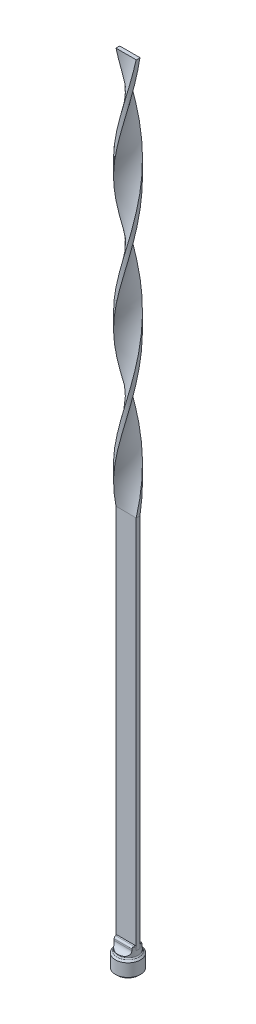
ISO-10303-21;
HEADER;
FILE_DESCRIPTION(('STEP AP214'),'2;1');
FILE_NAME('part.step','',(''),(''),'','','');
FILE_SCHEMA(('AUTOMOTIVE_DESIGN { 1 0 10303 214 1 1 1 1 }'));
ENDSEC;
DATA;
#1=APPLICATION_CONTEXT('core data for automotive mechanical design processes');
#2=APPLICATION_PROTOCOL_DEFINITION('international standard','automotive_design',2000,#1);
#3=PRODUCT_CONTEXT('',#1,'mechanical');
#4=PRODUCT('Part','Part','',(#3));
#5=PRODUCT_RELATED_PRODUCT_CATEGORY('part','',(#4));
#6=PRODUCT_DEFINITION_FORMATION('','',#4);
#7=PRODUCT_DEFINITION_CONTEXT('part definition',#1,'design');
#8=PRODUCT_DEFINITION('design','',#6,#7);
#9=PRODUCT_DEFINITION_SHAPE('','',#8);
#10=(LENGTH_UNIT() NAMED_UNIT(*) SI_UNIT(.MILLI.,.METRE.));
#11=(NAMED_UNIT(*) PLANE_ANGLE_UNIT() SI_UNIT($,.RADIAN.));
#12=(NAMED_UNIT(*) SI_UNIT($,.STERADIAN.) SOLID_ANGLE_UNIT());
#13=UNCERTAINTY_MEASURE_WITH_UNIT(LENGTH_MEASURE(1.E-05),#10,'distance_accuracy_value','');
#14=(GEOMETRIC_REPRESENTATION_CONTEXT(3) GLOBAL_UNCERTAINTY_ASSIGNED_CONTEXT((#13)) GLOBAL_UNIT_ASSIGNED_CONTEXT((#10,
#11,#12)) REPRESENTATION_CONTEXT('',''));
#15=CARTESIAN_POINT('',(0.,0.,0.));
#16=DIRECTION('',(0.,0.,1.));
#17=DIRECTION('',(1.,0.,0.));
#18=AXIS2_PLACEMENT_3D('',#15,#16,#17);
#19=CARTESIAN_POINT('',(-2.3622,0.,1.36381680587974));
#20=DIRECTION('',(-0.5,0.,0.866025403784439));
#21=DIRECTION('',(0.866025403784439,0.,0.5));
#22=AXIS2_PLACEMENT_3D('',#19,#20,#21);
#23=PLANE('',#22);
#24=DIRECTION('',(0.,1.,0.));
#25=VECTOR('',#24,1.);
#26=CARTESIAN_POINT('',(-2.3622,0.,1.36381680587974));
#27=LINE('',#26,#25);
#28=CARTESIAN_POINT('',(-2.36219999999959,0.0155663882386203,1.3638168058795));
#29=VERTEX_POINT('',#28);
#30=CARTESIAN_POINT('',(-2.3622,5.4102,1.36381680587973));
#31=VERTEX_POINT('',#30);
#32=EDGE_CURVE('E666',#29,#31,#27,.T.);
#33=ORIENTED_EDGE('',*,*,#32,.T.);
#34=DIRECTION('',(-0.866025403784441,0.,-0.5));
#35=VECTOR('',#34,1.);
#36=CARTESIAN_POINT('',(0.,5.4102,2.72763361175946));
#37=LINE('',#36,#35);
#38=CARTESIAN_POINT('',(0.,5.4102,2.72763361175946));
#39=VERTEX_POINT('',#38);
#40=EDGE_CURVE('E659',#39,#31,#37,.T.);
#41=ORIENTED_EDGE('',*,*,#40,.F.);
#42=DIRECTION('',(0.,1.,0.));
#43=VECTOR('',#42,1.);
#44=CARTESIAN_POINT('',(0.,0.,2.72763361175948));
#45=LINE('',#44,#43);
#46=CARTESIAN_POINT('',(-4.05896796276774E-13,0.0155663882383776,2.72763361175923));
#47=VERTEX_POINT('',#46);
#48=EDGE_CURVE('E336',#39,#47,#45,.F.);
#49=ORIENTED_EDGE('',*,*,#48,.T.);
#50=CARTESIAN_POINT('',(-2.36219999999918,0.0155663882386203,1.36381680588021));
#51=CARTESIAN_POINT('',(-2.28154043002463,0.0620917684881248,1.41038563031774));
#52=CARTESIAN_POINT('',(-2.19954081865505,0.105900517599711,1.45772812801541));
#53=CARTESIAN_POINT('',(-2.03230420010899,0.186202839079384,1.55428223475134));
#54=CARTESIAN_POINT('',(-1.94704980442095,0.222647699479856,1.60350388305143));
#55=CARTESIAN_POINT('',(-1.77407702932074,0.28558015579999,1.70336976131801));
#56=CARTESIAN_POINT('',(-1.686368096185,0.312101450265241,1.75400853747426));
#57=CARTESIAN_POINT('',(-1.50902744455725,0.352932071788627,1.85639621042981));
#58=CARTESIAN_POINT('',(-1.41940256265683,0.367279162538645,1.9081411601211));
#59=CARTESIAN_POINT('',(-1.3047260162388,0.376863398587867,1.97434969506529));
#60=CARTESIAN_POINT('',(-1.28001324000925,0.37841288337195,1.98861762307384));
#61=CARTESIAN_POINT('',(-1.23056804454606,0.38048128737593,2.01716481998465));
#62=CARTESIAN_POINT('',(-1.20583564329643,0.381000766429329,2.03144407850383));
#63=CARTESIAN_POINT('',(-1.11901839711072,0.38099807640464,2.08156803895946));
#64=CARTESIAN_POINT('',(-1.0569163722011,0.377719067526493,2.11742265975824));
#65=CARTESIAN_POINT('',(-0.933187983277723,0.364783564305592,2.18885727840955));
#66=CARTESIAN_POINT('',(-0.87156198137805,0.355122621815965,2.22443706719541));
#67=CARTESIAN_POINT('',(-0.748942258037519,0.329877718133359,2.29523159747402));
#68=CARTESIAN_POINT('',(-0.68795279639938,0.314266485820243,2.33044387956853));
#69=CARTESIAN_POINT('',(-0.567144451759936,0.277831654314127,2.40019260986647));
#70=CARTESIAN_POINT('',(-0.507326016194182,0.25700610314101,2.43472879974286));
#71=CARTESIAN_POINT('',(-0.370927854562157,0.203889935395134,2.51347831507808));
#72=CARTESIAN_POINT('',(-0.294808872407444,0.170040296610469,2.55742562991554));
#73=CARTESIAN_POINT('',(-0.145452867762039,0.0966774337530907,2.64365635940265));
#74=CARTESIAN_POINT('',(-0.0721958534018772,0.0572188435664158,2.68595131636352));
#75=CARTESIAN_POINT('',(-8.22908622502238E-13,0.0155663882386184,2.72763361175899));
#76=B_SPLINE_CURVE_WITH_KNOTS('',3,(#50,#51,#52,#53,#54,#55,#56,#57,#58,#59,#60,#61,#62,#63,#64,
#65,#66,#67,#68,#69,#70,#71,#72,#73,#74,#75),.UNSPECIFIED.,.F.,.F.,(4,2,2,2,2,2,2,2,2,2,2,2,4),
(0.,0.312550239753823,0.627104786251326,0.940581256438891,1.25308174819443,1.33880263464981,
1.42447691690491,1.63950252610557,1.85467816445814,2.07085208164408,2.28710704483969,
2.56941094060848,2.84913273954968),.UNSPECIFIED.);
#77=EDGE_CURVE('E298',#29,#47,#76,.T.);
#78=ORIENTED_EDGE('',*,*,#77,.F.);
#79=EDGE_LOOP('',(#33,#41,#49,#78));
#80=FACE_BOUND('',#79,.T.);
#81=ADVANCED_FACE('F15',(#80),#23,.F.);
#82=CARTESIAN_POINT('',(-2.3622,0.,-1.36381680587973));
#83=DIRECTION('',(-1.,0.,0.));
#84=DIRECTION('',(0.,0.,1.));
#85=AXIS2_PLACEMENT_3D('',#82,#83,#84);
#86=PLANE('',#85);
#87=DIRECTION('',(0.,1.,0.));
#88=VECTOR('',#87,1.);
#89=CARTESIAN_POINT('',(-2.3622,0.,-1.36381680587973));
#90=LINE('',#89,#88);
#91=CARTESIAN_POINT('',(-2.36219999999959,0.0155663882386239,-1.36381680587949));
#92=VERTEX_POINT('',#91);
#93=CARTESIAN_POINT('',(-2.3622,5.4102,-1.36381680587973));
#94=VERTEX_POINT('',#93);
#95=EDGE_CURVE('E335',#92,#94,#90,.T.);
#96=ORIENTED_EDGE('',*,*,#95,.T.);
#97=DIRECTION('',(0.,0.,-1.));
#98=VECTOR('',#97,1.);
#99=CARTESIAN_POINT('',(-2.3622,5.4102,0.));
#100=LINE('',#99,#98);
#101=EDGE_CURVE('E662',#31,#94,#100,.T.);
#102=ORIENTED_EDGE('',*,*,#101,.F.);
#103=ORIENTED_EDGE('',*,*,#32,.F.);
#104=CARTESIAN_POINT('',(-2.3622,0.015566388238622,-1.36381680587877));
#105=CARTESIAN_POINT('',(-2.3622,0.0620917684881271,-1.27067915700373));
#106=CARTESIAN_POINT('',(-2.3622,0.105900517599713,-1.17599416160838));
#107=CARTESIAN_POINT('',(-2.3622,0.186202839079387,-0.982885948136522));
#108=CARTESIAN_POINT('',(-2.3622,0.222647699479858,-0.884442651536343));
#109=CARTESIAN_POINT('',(-2.3622,0.285580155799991,-0.684710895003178));
#110=CARTESIAN_POINT('',(-2.3622,0.312101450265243,-0.583433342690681));
#111=CARTESIAN_POINT('',(-2.3622,0.352932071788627,-0.378657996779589));
#112=CARTESIAN_POINT('',(-2.3622,0.367279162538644,-0.275168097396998));
#113=CARTESIAN_POINT('',(-2.3622,0.376863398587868,-0.142751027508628));
#114=CARTESIAN_POINT('',(-2.3622,0.37841288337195,-0.11421517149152));
#115=CARTESIAN_POINT('',(-2.3622,0.380481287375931,-0.0571207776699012));
#116=CARTESIAN_POINT('',(-2.3622,0.38100076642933,-0.0285622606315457));
#117=CARTESIAN_POINT('',(-2.3622,0.38099807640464,0.0716856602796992));
#118=CARTESIAN_POINT('',(-2.3622,0.377719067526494,0.143394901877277));
#119=CARTESIAN_POINT('',(-2.3622,0.364783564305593,0.286264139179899));
#120=CARTESIAN_POINT('',(-2.3622,0.355122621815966,0.357423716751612));
#121=CARTESIAN_POINT('',(-2.3622,0.329877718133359,0.499012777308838));
#122=CARTESIAN_POINT('',(-2.3622,0.314266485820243,0.569437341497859));
#123=CARTESIAN_POINT('',(-2.3622,0.277831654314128,0.70893480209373));
#124=CARTESIAN_POINT('',(-2.3622,0.257006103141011,0.778007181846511));
#125=CARTESIAN_POINT('',(-2.3622,0.203889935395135,0.93550621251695));
#126=CARTESIAN_POINT('',(-2.3622,0.170040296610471,1.02340084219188));
#127=CARTESIAN_POINT('',(-2.3622,0.0966774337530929,1.1958623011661));
#128=CARTESIAN_POINT('',(-2.3622,0.0572188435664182,1.28045221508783));
#129=CARTESIAN_POINT('',(-2.3622,0.0155663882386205,1.36381680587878));
#130=B_SPLINE_CURVE_WITH_KNOTS('',3,(#104,#105,#106,#107,#108,#109,#110,#111,#112,#113,#114,
#115,#116,#117,#118,#119,#120,#121,#122,#123,#124,#125,#126,#127,#128,#129),.UNSPECIFIED.,.F.,
.F.,(4,2,2,2,2,2,2,2,2,2,2,2,4),(0.,0.312550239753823,0.627104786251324,0.940581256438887,
1.25308174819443,1.3388026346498,1.42447691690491,1.63950252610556,1.85467816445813,
2.07085208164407,2.28710704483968,2.56941094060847,2.84913273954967),.UNSPECIFIED.);
#131=EDGE_CURVE('E131',#92,#29,#130,.T.);
#132=ORIENTED_EDGE('',*,*,#131,.F.);
#133=EDGE_LOOP('',(#96,#102,#103,#132));
#134=FACE_BOUND('',#133,.T.);
#135=ADVANCED_FACE('F345',(#134),#86,.F.);
#136=CARTESIAN_POINT('',(0.,0.,2.72763361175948));
#137=DIRECTION('',(0.5,0.,0.866025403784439));
#138=DIRECTION('',(0.866025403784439,0.,-0.5));
#139=AXIS2_PLACEMENT_3D('',#136,#137,#138);
#140=PLANE('',#139);
#141=ORIENTED_EDGE('',*,*,#48,.F.);
#142=DIRECTION('',(-0.866025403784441,0.,0.5));
#143=VECTOR('',#142,1.);
#144=CARTESIAN_POINT('',(2.3622,5.4102,1.36381680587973));
#145=LINE('',#144,#143);
#146=CARTESIAN_POINT('',(2.3622,5.4102,1.36381680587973));
#147=VERTEX_POINT('',#146);
#148=EDGE_CURVE('E663',#147,#39,#145,.T.);
#149=ORIENTED_EDGE('',*,*,#148,.F.);
#150=DIRECTION('',(0.,1.,0.));
#151=VECTOR('',#150,1.);
#152=CARTESIAN_POINT('',(2.3622,0.,1.36381680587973));
#153=LINE('',#152,#151);
#154=CARTESIAN_POINT('',(2.36219999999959,0.0155663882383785,1.36381680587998));
#155=VERTEX_POINT('',#154);
#156=EDGE_CURVE('E699',#147,#155,#153,.F.);
#157=ORIENTED_EDGE('',*,*,#156,.T.);
#158=CARTESIAN_POINT('',(8.34335602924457E-13,0.0155663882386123,2.727633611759));
#159=CARTESIAN_POINT('',(0.0806595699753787,0.0620917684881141,2.68106478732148));
#160=CARTESIAN_POINT('',(0.162659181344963,0.105900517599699,2.63372228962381));
#161=CARTESIAN_POINT('',(0.329895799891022,0.186202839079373,2.53716818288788));
#162=CARTESIAN_POINT('',(0.415150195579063,0.222647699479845,2.48794653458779));
#163=CARTESIAN_POINT('',(0.588122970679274,0.285580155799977,2.3880806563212));
#164=CARTESIAN_POINT('',(0.675831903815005,0.312101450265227,2.33744188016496));
#165=CARTESIAN_POINT('',(0.853172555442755,0.352932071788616,2.23505420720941));
#166=CARTESIAN_POINT('',(0.942797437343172,0.367279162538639,2.18330925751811));
#167=CARTESIAN_POINT('',(1.0574739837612,0.376863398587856,2.11710072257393));
#168=CARTESIAN_POINT('',(1.08218675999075,0.378412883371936,2.10283279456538));
#169=CARTESIAN_POINT('',(1.13163195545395,0.380481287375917,2.07428559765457));
#170=CARTESIAN_POINT('',(1.15636435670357,0.381000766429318,2.06000633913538));
#171=CARTESIAN_POINT('',(1.24318160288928,0.380998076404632,2.00988237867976));
#172=CARTESIAN_POINT('',(1.3052836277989,0.377719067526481,1.97402775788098));
#173=CARTESIAN_POINT('',(1.42901201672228,0.364783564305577,1.90259313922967));
#174=CARTESIAN_POINT('',(1.49063801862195,0.355122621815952,1.86701335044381));
#175=CARTESIAN_POINT('',(1.61325774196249,0.329877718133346,1.7962188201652));
#176=CARTESIAN_POINT('',(1.67424720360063,0.314266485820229,1.76100653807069));
#177=CARTESIAN_POINT('',(1.79505554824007,0.277831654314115,1.69125780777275));
#178=CARTESIAN_POINT('',(1.85487398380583,0.257006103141,1.65672161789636));
#179=CARTESIAN_POINT('',(1.99127214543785,0.203889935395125,1.57797210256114));
#180=CARTESIAN_POINT('',(2.06739112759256,0.170040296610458,1.53402478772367));
#181=CARTESIAN_POINT('',(2.21674713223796,0.096677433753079,1.44779405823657));
#182=CARTESIAN_POINT('',(2.29000414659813,0.0572188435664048,1.4054991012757));
#183=CARTESIAN_POINT('',(2.36219999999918,0.0155663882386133,1.36381680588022));
#184=B_SPLINE_CURVE_WITH_KNOTS('',3,(#158,#159,#160,#161,#162,#163,#164,#165,#166,#167,#168,
#169,#170,#171,#172,#173,#174,#175,#176,#177,#178,#179,#180,#181,#182,#183),.UNSPECIFIED.,.F.,
.F.,(4,2,2,2,2,2,2,2,2,2,2,2,4),(0.,0.31255023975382,0.627104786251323,0.940581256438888,
1.25308174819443,1.3388026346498,1.4244769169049,1.63950252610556,1.85467816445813,
2.07085208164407,2.28710704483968,2.56941094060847,2.84913273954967),.UNSPECIFIED.);
#185=EDGE_CURVE('E329',#47,#155,#184,.T.);
#186=ORIENTED_EDGE('',*,*,#185,.F.);
#187=EDGE_LOOP('',(#141,#149,#157,#186));
#188=FACE_BOUND('',#187,.T.);
#189=ADVANCED_FACE('F341',(#188),#140,.F.);
#190=CARTESIAN_POINT('',(0.,0.,-2.72763361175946));
#191=DIRECTION('',(-0.5,0.,-0.866025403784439));
#192=DIRECTION('',(-0.866025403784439,0.,0.5));
#193=AXIS2_PLACEMENT_3D('',#190,#191,#192);
#194=PLANE('',#193);
#195=DIRECTION('',(0.,1.,0.));
#196=VECTOR('',#195,1.);
#197=CARTESIAN_POINT('',(0.,0.,-2.72763361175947));
#198=LINE('',#197,#196);
#199=CARTESIAN_POINT('',(0.,0.0155663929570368,-2.72763360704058));
#200=VERTEX_POINT('',#199);
#201=CARTESIAN_POINT('',(0.,5.4102,-2.72763361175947));
#202=VERTEX_POINT('',#201);
#203=EDGE_CURVE('E694',#200,#202,#198,.T.);
#204=ORIENTED_EDGE('',*,*,#203,.T.);
#205=DIRECTION('',(0.866025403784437,0.,-0.5));
#206=VECTOR('',#205,1.);
#207=CARTESIAN_POINT('',(-2.3622,5.4102,-1.36381680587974));
#208=LINE('',#207,#206);
#209=EDGE_CURVE('E672',#94,#202,#208,.T.);
#210=ORIENTED_EDGE('',*,*,#209,.F.);
#211=ORIENTED_EDGE('',*,*,#95,.F.);
#212=CARTESIAN_POINT('',(-6.58945370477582E-09,0.0155663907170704,-2.72763360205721));
#213=CARTESIAN_POINT('',(-0.0806595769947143,0.0620917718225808,-2.6810647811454));
#214=CARTESIAN_POINT('',(-0.162659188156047,0.105900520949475,-2.63372228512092));
#215=CARTESIAN_POINT('',(-0.329895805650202,0.186202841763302,-2.53716818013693));
#216=CARTESIAN_POINT('',(-0.415150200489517,0.222647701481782,-2.48794653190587));
#217=CARTESIAN_POINT('',(-0.588122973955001,0.285580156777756,-2.3880806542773));
#218=CARTESIAN_POINT('',(-0.675831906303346,0.312101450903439,-2.337441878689));
#219=CARTESIAN_POINT('',(-0.853172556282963,0.352932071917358,-2.23505420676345));
#220=CARTESIAN_POINT('',(-0.942797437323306,0.367279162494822,-2.18330925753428));
#221=CARTESIAN_POINT('',(-1.05747398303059,0.376863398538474,-2.11710072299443));
#222=CARTESIAN_POINT('',(-1.08218675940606,0.378412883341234,-2.10283279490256));
#223=CARTESIAN_POINT('',(-1.13163195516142,0.380481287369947,-2.07428559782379));
#224=CARTESIAN_POINT('',(-1.15636435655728,0.3810007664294,-2.06000633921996));
#225=CARTESIAN_POINT('',(-1.24318160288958,0.380998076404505,-2.00988237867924));
#226=CARTESIAN_POINT('',(-1.30528362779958,0.377719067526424,-1.97402775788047));
#227=CARTESIAN_POINT('',(-1.42901201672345,0.364783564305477,-1.90259313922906));
#228=CARTESIAN_POINT('',(-1.49063801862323,0.355122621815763,-1.86701335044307));
#229=CARTESIAN_POINT('',(-1.61325774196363,0.329877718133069,-1.79621882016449));
#230=CARTESIAN_POINT('',(-1.67424720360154,0.314266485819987,-1.76100653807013));
#231=CARTESIAN_POINT('',(-1.79505554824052,0.277831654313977,-1.69125780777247));
#232=CARTESIAN_POINT('',(-1.85487398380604,0.257006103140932,-1.65672161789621));
#233=CARTESIAN_POINT('',(-1.99127214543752,0.203889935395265,-1.5779721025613));
#234=CARTESIAN_POINT('',(-2.06739112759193,0.170040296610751,-1.53402478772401));
#235=CARTESIAN_POINT('',(-2.21674713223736,0.0966774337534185,-1.44779405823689));
#236=CARTESIAN_POINT('',(-2.29000414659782,0.0572188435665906,-1.40549910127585));
#237=CARTESIAN_POINT('',(-2.36219999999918,0.0155663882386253,-1.3638168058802));
#238=B_SPLINE_CURVE_WITH_KNOTS('',3,(#212,#213,#214,#215,#216,#217,#218,#219,#220,#221,#222,
#223,#224,#225,#226,#227,#228,#229,#230,#231,#232,#233,#234,#235,#236,#237),.UNSPECIFIED.,.F.,
.F.,(4,2,2,2,2,2,2,2,2,2,2,2,4),(0.,0.312550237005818,0.627104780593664,0.940581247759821,
1.25308173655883,1.33880262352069,1.42447690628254,1.63950251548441,1.8546781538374,
2.07085207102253,2.28710703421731,2.56941092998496,2.84913272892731),.UNSPECIFIED.);
#239=EDGE_CURVE('E322',#200,#92,#238,.T.);
#240=ORIENTED_EDGE('',*,*,#239,.F.);
#241=EDGE_LOOP('',(#204,#210,#211,#240));
#242=FACE_BOUND('',#241,.T.);
#243=ADVANCED_FACE('F344',(#242),#194,.F.);
#244=CARTESIAN_POINT('',(0.,5.4102,0.));
#245=DIRECTION('',(0.,-1.,0.));
#246=DIRECTION('',(0.,0.,-1.));
#247=AXIS2_PLACEMENT_3D('',#244,#245,#246);
#248=PLANE('',#247);
#249=ORIENTED_EDGE('',*,*,#101,.T.);
#250=ORIENTED_EDGE('',*,*,#209,.T.);
#251=DIRECTION('',(-0.866025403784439,0.,-0.5));
#252=VECTOR('',#251,1.);
#253=CARTESIAN_POINT('',(2.3622,5.4102,-1.36381680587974));
#254=LINE('',#253,#252);
#255=CARTESIAN_POINT('',(2.3622,5.4102,-1.36381680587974));
#256=VERTEX_POINT('',#255);
#257=EDGE_CURVE('E691',#202,#256,#254,.F.);
#258=ORIENTED_EDGE('',*,*,#257,.T.);
#259=DIRECTION('',(0.,0.,-1.));
#260=VECTOR('',#259,1.);
#261=CARTESIAN_POINT('',(2.3622,5.4102,1.36381680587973));
#262=LINE('',#261,#260);
#263=EDGE_CURVE('E688',#256,#147,#262,.F.);
#264=ORIENTED_EDGE('',*,*,#263,.T.);
#265=ORIENTED_EDGE('',*,*,#148,.T.);
#266=ORIENTED_EDGE('',*,*,#40,.T.);
#267=EDGE_LOOP('',(#249,#250,#258,#264,#265,#266));
#268=FACE_BOUND('',#267,.T.);
#269=ADVANCED_FACE('F1130',(#268),#248,.T.);
#270=CARTESIAN_POINT('',(2.3622,0.,1.36381680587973));
#271=DIRECTION('',(1.,0.,0.));
#272=DIRECTION('',(0.,0.,-1.));
#273=AXIS2_PLACEMENT_3D('',#270,#271,#272);
#274=PLANE('',#273);
#275=ORIENTED_EDGE('',*,*,#156,.F.);
#276=ORIENTED_EDGE('',*,*,#263,.F.);
#277=DIRECTION('',(0.,1.,0.));
#278=VECTOR('',#277,1.);
#279=CARTESIAN_POINT('',(2.3622,0.,-1.36381680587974));
#280=LINE('',#279,#278);
#281=CARTESIAN_POINT('',(2.3622,0.0155663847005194,-1.36381681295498));
#282=VERTEX_POINT('',#281);
#283=EDGE_CURVE('E693',#256,#282,#280,.F.);
#284=ORIENTED_EDGE('',*,*,#283,.T.);
#285=CARTESIAN_POINT('',(2.3622,0.0155663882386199,1.36381680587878));
#286=CARTESIAN_POINT('',(2.3622,0.062091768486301,1.27067915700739));
#287=CARTESIAN_POINT('',(2.3622,0.105900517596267,1.17599416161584));
#288=CARTESIAN_POINT('',(2.3622,0.186202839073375,0.982885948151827));
#289=CARTESIAN_POINT('',(2.3622,0.222647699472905,0.884442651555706));
#290=CARTESIAN_POINT('',(2.3622,0.285580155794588,0.684710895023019));
#291=CARTESIAN_POINT('',(2.3622,0.312101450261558,0.583433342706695));
#292=CARTESIAN_POINT('',(2.3622,0.352932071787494,0.378657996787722));
#293=CARTESIAN_POINT('',(2.3622,0.367279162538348,0.275168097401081));
#294=CARTESIAN_POINT('',(2.3622,0.376863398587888,0.142751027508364));
#295=CARTESIAN_POINT('',(2.3622,0.37841288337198,0.114215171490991));
#296=CARTESIAN_POINT('',(2.3622,0.380481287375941,0.057120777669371));
#297=CARTESIAN_POINT('',(2.3622,0.38100076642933,0.0285622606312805));
#298=CARTESIAN_POINT('',(2.3622,0.380998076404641,-0.0716856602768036));
#299=CARTESIAN_POINT('',(2.3622,0.377719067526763,-0.143394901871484));
#300=CARTESIAN_POINT('',(2.3622,0.364783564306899,-0.286264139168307));
#301=CARTESIAN_POINT('',(2.3622,0.355122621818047,-0.35742371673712));
#302=CARTESIAN_POINT('',(2.3622,0.329877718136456,-0.499012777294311));
#303=CARTESIAN_POINT('',(2.3622,0.314266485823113,-0.569437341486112));
#304=CARTESIAN_POINT('',(2.3622,0.277831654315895,-0.708934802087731));
#305=CARTESIAN_POINT('',(2.3622,0.257006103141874,-0.778007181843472));
#306=CARTESIAN_POINT('',(2.3622,0.203889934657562,-0.935506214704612));
#307=CARTESIAN_POINT('',(2.3622,0.170040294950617,-1.02340084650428));
#308=CARTESIAN_POINT('',(2.3622,0.096677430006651,-1.19586230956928));
#309=CARTESIAN_POINT('',(2.3622,0.0572188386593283,-1.28045222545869));
#310=CARTESIAN_POINT('',(2.3622,0.0155663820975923,-1.36381681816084));
#311=B_SPLINE_CURVE_WITH_KNOTS('',3,(#285,#286,#287,#288,#289,#290,#291,#292,#293,#294,#295,
#296,#297,#298,#299,#300,#301,#302,#303,#304,#305,#306,#307,#308,#309,#310),.UNSPECIFIED.,.F.,
.F.,(4,2,2,2,2,2,2,2,2,2,2,2,4),(0.,0.312550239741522,0.627104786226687,0.940581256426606,
1.25308174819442,1.33880263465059,1.4244769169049,1.63950252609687,1.85467816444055,
2.07085208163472,2.28710704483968,2.5694109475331,2.84913275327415),.UNSPECIFIED.);
#312=EDGE_CURVE('E316',#155,#282,#311,.T.);
#313=ORIENTED_EDGE('',*,*,#312,.F.);
#314=EDGE_LOOP('',(#275,#276,#284,#313));
#315=FACE_BOUND('',#314,.T.);
#316=ADVANCED_FACE('F1139',(#315),#274,.F.);
#317=CARTESIAN_POINT('',(2.3622,0.,-1.36381680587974));
#318=DIRECTION('',(0.5,0.,-0.866025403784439));
#319=DIRECTION('',(-0.866025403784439,0.,-0.5));
#320=AXIS2_PLACEMENT_3D('',#317,#318,#319);
#321=PLANE('',#320);
#322=ORIENTED_EDGE('',*,*,#283,.F.);
#323=ORIENTED_EDGE('',*,*,#257,.F.);
#324=ORIENTED_EDGE('',*,*,#203,.F.);
#325=CARTESIAN_POINT('',(8.17335955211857E-09,0.0155663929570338,-2.72763360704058));
#326=CARTESIAN_POINT('',(0.0806595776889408,0.0620917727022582,-2.68106478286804));
#327=CARTESIAN_POINT('',(0.16265918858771,0.105900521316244,-2.63372228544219));
#328=CARTESIAN_POINT('',(0.32989580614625,0.186202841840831,-2.5371681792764));
#329=CARTESIAN_POINT('',(0.41515020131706,0.222647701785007,-2.48794653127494));
#330=CARTESIAN_POINT('',(0.588122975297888,0.285580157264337,-2.38808065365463));
#331=CARTESIAN_POINT('',(0.675831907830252,0.31210145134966,-2.33744187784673));
#332=CARTESIAN_POINT('',(0.853172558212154,0.352932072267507,-2.23505420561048));
#333=CARTESIAN_POINT('',(0.942797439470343,0.367279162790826,-2.18330925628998));
#334=CARTESIAN_POINT('',(1.05747398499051,0.376863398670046,-2.11710072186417));
#335=CARTESIAN_POINT('',(1.08218676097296,0.378412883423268,-2.10283279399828));
#336=CARTESIAN_POINT('',(1.13163195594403,0.380481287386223,-2.0742855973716));
#337=CARTESIAN_POINT('',(1.15636435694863,0.381000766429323,-2.06000633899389));
#338=CARTESIAN_POINT('',(1.24318160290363,0.380998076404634,-2.00988237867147));
#339=CARTESIAN_POINT('',(1.30528362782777,0.377719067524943,-1.9740277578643));
#340=CARTESIAN_POINT('',(1.4290120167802,0.364783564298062,-1.90259313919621));
#341=CARTESIAN_POINT('',(1.4906380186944,0.355122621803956,-1.86701335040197));
#342=CARTESIAN_POINT('',(1.61325774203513,0.329877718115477,-1.79621882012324));
#343=CARTESIAN_POINT('',(1.67424720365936,0.314266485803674,-1.76100653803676));
#344=CARTESIAN_POINT('',(1.79505554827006,0.277831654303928,-1.69125780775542));
#345=CARTESIAN_POINT('',(1.85487398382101,0.257006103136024,-1.65672161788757));
#346=CARTESIAN_POINT('',(1.99127213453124,0.203889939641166,-1.57797210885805));
#347=CARTESIAN_POINT('',(2.06739110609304,0.170040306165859,-1.53402480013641));
#348=CARTESIAN_POINT('',(2.21674709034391,0.0966774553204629,-1.4477940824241));
#349=CARTESIAN_POINT('',(2.29000409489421,0.0572188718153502,-1.40549913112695));
#350=CARTESIAN_POINT('',(2.362199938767,0.0155664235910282,-1.36381684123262));
#351=B_SPLINE_CURVE_WITH_KNOTS('',3,(#325,#326,#327,#328,#329,#330,#331,#332,#333,#334,#335,
#336,#337,#338,#339,#340,#341,#342,#343,#344,#345,#346,#347,#348,#349,#350),.UNSPECIFIED.,.F.,
.F.,(4,2,2,2,2,2,2,2,2,2,2,2,4),(0.,0.312550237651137,0.627104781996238,0.940581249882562,
1.25308173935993,1.33880262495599,1.42447690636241,1.63950251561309,1.85467815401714,
2.07085207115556,2.28710703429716,2.56941089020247,2.84913264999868),.UNSPECIFIED.);
#352=EDGE_CURVE('E308',#200,#282,#351,.T.);
#353=ORIENTED_EDGE('',*,*,#352,.T.);
#354=EDGE_LOOP('',(#322,#323,#324,#353));
#355=FACE_BOUND('',#354,.T.);
#356=ADVANCED_FACE('F291',(#355),#321,.F.);
#357=CARTESIAN_POINT('',(0.,-5.68440337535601E-11,0.));
#358=DIRECTION('',(0.,-1.,0.));
#359=DIRECTION('',(0.,0.,-1.));
#360=AXIS2_PLACEMENT_3D('',#357,#358,#359);
#361=CONICAL_SURFACE('',#360,2.74320000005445,0.785398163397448);
#362=CARTESIAN_POINT('',(0.,-5.68444674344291E-11,0.));
#363=DIRECTION('',(0.,-1.,0.));
#364=DIRECTION('',(0.,0.,-1.));
#365=AXIS2_PLACEMENT_3D('',#362,#363,#364);
#366=CIRCLE('',#365,2.74320000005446);
#367=CARTESIAN_POINT('',(0.,-5.68450823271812E-11,-2.74320000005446));
#368=VERTEX_POINT('',#367);
#369=EDGE_CURVE('E723',#368,#368,#366,.F.);
#370=ORIENTED_EDGE('',*,*,#369,.F.);
#371=EDGE_LOOP('',(#370));
#372=FACE_BOUND('',#371,.T.);
#373=ORIENTED_EDGE('',*,*,#352,.F.);
#374=ORIENTED_EDGE('',*,*,#239,.T.);
#375=ORIENTED_EDGE('',*,*,#131,.T.);
#376=ORIENTED_EDGE('',*,*,#77,.T.);
#377=ORIENTED_EDGE('',*,*,#185,.T.);
#378=ORIENTED_EDGE('',*,*,#312,.T.);
#379=EDGE_LOOP('',(#373,#374,#375,#376,#377,#378));
#380=FACE_BOUND('',#379,.T.);
#381=ADVANCED_FACE('F286',(#372,#380),#361,.F.);
#382=CARTESIAN_POINT('',(0.,0.,-2.3622));
#383=DIRECTION('',(0.,-1.,0.));
#384=DIRECTION('',(0.,0.,-1.));
#385=AXIS2_PLACEMENT_3D('',#382,#383,#384);
#386=PLANE('',#385);
#387=ORIENTED_EDGE('',*,*,#369,.T.);
#388=EDGE_LOOP('',(#387));
#389=FACE_BOUND('',#388,.T.);
#390=CARTESIAN_POINT('',(0.,-1.13686946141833E-10,0.));
#391=DIRECTION('',(0.,1.,0.));
#392=DIRECTION('',(0.,0.,1.));
#393=AXIS2_PLACEMENT_3D('',#390,#391,#392);
#394=CIRCLE('',#393,4.19099999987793);
#395=CARTESIAN_POINT('',(0.,-1.13686001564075E-10,4.19099999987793));
#396=VERTEX_POINT('',#395);
#397=EDGE_CURVE('E718',#396,#396,#394,.T.);
#398=ORIENTED_EDGE('',*,*,#397,.F.);
#399=EDGE_LOOP('',(#398));
#400=FACE_BOUND('',#399,.T.);
#401=ADVANCED_FACE('F282',(#389,#400),#386,.T.);
#402=CARTESIAN_POINT('',(0.,0.619499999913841,0.));
#403=DIRECTION('',(0.,1.,0.));
#404=DIRECTION('',(0.,0.,1.));
#405=AXIS2_PLACEMENT_3D('',#402,#403,#404);
#406=CONICAL_SURFACE('',#405,4.81049999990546,0.785398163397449);
#407=CARTESIAN_POINT('',(0.,0.6195,0.));
#408=DIRECTION('',(0.,-1.,0.));
#409=DIRECTION('',(0.,0.,-1.));
#410=AXIS2_PLACEMENT_3D('',#407,#408,#409);
#411=CIRCLE('',#410,4.8105);
#412=CARTESIAN_POINT('',(0.,0.619499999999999,-4.8105));
#413=VERTEX_POINT('',#412);
#414=EDGE_CURVE('E714',#413,#413,#411,.F.);
#415=ORIENTED_EDGE('',*,*,#414,.F.);
#416=EDGE_LOOP('',(#415));
#417=FACE_BOUND('',#416,.T.);
#418=ORIENTED_EDGE('',*,*,#397,.T.);
#419=EDGE_LOOP('',(#418));
#420=FACE_BOUND('',#419,.T.);
#421=ADVANCED_FACE('F278',(#417,#420),#406,.T.);
#422=CARTESIAN_POINT('',(0.,3.048,0.));
#423=DIRECTION('',(0.,-1.,0.));
#424=DIRECTION('',(0.,0.,-1.));
#425=AXIS2_PLACEMENT_3D('',#422,#423,#424);
#426=CYLINDRICAL_SURFACE('',#425,4.8105);
#427=CARTESIAN_POINT('',(0.,5.47649999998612,0.));
#428=DIRECTION('',(0.,-1.,0.));
#429=DIRECTION('',(0.,0.,1.));
#430=AXIS2_PLACEMENT_3D('',#427,#428,#429);
#431=CIRCLE('',#430,4.81050000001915);
#432=CARTESIAN_POINT('',(0.,5.47649999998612,4.81050000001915));
#433=VERTEX_POINT('',#432);
#434=EDGE_CURVE('E711',#433,#433,#431,.F.);
#435=ORIENTED_EDGE('',*,*,#434,.F.);
#436=EDGE_LOOP('',(#435));
#437=FACE_BOUND('',#436,.T.);
#438=ORIENTED_EDGE('',*,*,#414,.T.);
#439=EDGE_LOOP('',(#438));
#440=FACE_BOUND('',#439,.T.);
#441=ADVANCED_FACE('F274',(#437,#440),#426,.T.);
#442=CARTESIAN_POINT('',(0.,5.4765000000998,0.));
#443=DIRECTION('',(0.,-1.,0.));
#444=DIRECTION('',(0.,0.,-1.));
#445=AXIS2_PLACEMENT_3D('',#442,#443,#444);
#446=CONICAL_SURFACE('',#445,4.81049999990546,0.785398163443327);
#447=CARTESIAN_POINT('',(0.,6.096,0.));
#448=DIRECTION('',(0.,-1.,0.));
#449=DIRECTION('',(0.,0.,-1.));
#450=AXIS2_PLACEMENT_3D('',#447,#448,#449);
#451=CIRCLE('',#450,4.191);
#452=CARTESIAN_POINT('',(0.,6.096,-4.191));
#453=VERTEX_POINT('',#452);
#454=EDGE_CURVE('E240',#453,#453,#451,.T.);
#455=ORIENTED_EDGE('',*,*,#454,.T.);
#456=EDGE_LOOP('',(#455));
#457=FACE_BOUND('',#456,.T.);
#458=ORIENTED_EDGE('',*,*,#434,.T.);
#459=EDGE_LOOP('',(#458));
#460=FACE_BOUND('',#459,.T.);
#461=ADVANCED_FACE('F268',(#457,#460),#446,.T.);
#462=CARTESIAN_POINT('',(0.,6.5615896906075,0.));
#463=DIRECTION('',(0.,-1.,0.));
#464=DIRECTION('',(0.,0.,-1.));
#465=AXIS2_PLACEMENT_3D('',#462,#463,#464);
#466=TOROIDAL_SURFACE('',#465,4.39420000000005,0.508);
#467=ORIENTED_EDGE('',*,*,#454,.F.);
#468=EDGE_LOOP('',(#467));
#469=FACE_BOUND('',#468,.T.);
#470=CARTESIAN_POINT('',(0.,6.5615896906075,0.));
#471=DIRECTION('',(0.,-1.,0.));
#472=DIRECTION('',(0.,0.,-1.));
#473=AXIS2_PLACEMENT_3D('',#470,#471,#472);
#474=CIRCLE('',#473,3.8862);
#475=CARTESIAN_POINT('',(0.,6.5615896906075,-3.8862));
#476=VERTEX_POINT('',#475);
#477=EDGE_CURVE('E237',#476,#476,#474,.F.);
#478=ORIENTED_EDGE('',*,*,#477,.F.);
#479=EDGE_LOOP('',(#478));
#480=FACE_BOUND('',#479,.T.);
#481=ADVANCED_FACE('F263',(#469,#480),#466,.F.);
#482=CARTESIAN_POINT('',(0.,8.763,-3.8608));
#483=DIRECTION('',(1.,0.,0.));
#484=DIRECTION('',(0.,0.,-1.));
#485=AXIS2_PLACEMENT_3D('',#482,#483,#484);
#486=CYLINDRICAL_SURFACE('',#485,1.9558);
#487=DIRECTION('',(1.,0.,0.));
#488=VECTOR('',#487,1.);
#489=CARTESIAN_POINT('',(0.,8.763,-1.905));
#490=LINE('',#489,#488);
#491=CARTESIAN_POINT('',(-3.38725928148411,8.763,-1.905));
#492=VERTEX_POINT('',#491);
#493=CARTESIAN_POINT('',(3.38725928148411,8.763,-1.905));
#494=VERTEX_POINT('',#493);
#495=EDGE_CURVE('E241',#492,#494,#490,.T.);
#496=ORIENTED_EDGE('',*,*,#495,.T.);
#497=CARTESIAN_POINT('',(-3.3872592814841,8.763,-1.905));
#498=CARTESIAN_POINT('',(-3.38725570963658,8.7148407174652,-1.90499261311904));
#499=CARTESIAN_POINT('',(-3.38625874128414,8.66668356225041,-1.9067786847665));
#500=CARTESIAN_POINT('',(-3.3822530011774,8.57071712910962,-1.91388232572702));
#501=CARTESIAN_POINT('',(-3.379244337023,8.52290783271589,-1.91919970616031));
#502=CARTESIAN_POINT('',(-3.37119526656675,8.42803523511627,-1.93330167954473));
#503=CARTESIAN_POINT('',(-3.36615742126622,8.38097107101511,-1.94208190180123));
#504=CARTESIAN_POINT('',(-3.35400900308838,8.2878785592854,-1.96298723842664));
#505=CARTESIAN_POINT('',(-3.3468984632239,8.24185019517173,-1.97511229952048));
#506=CARTESIAN_POINT('',(-3.32236041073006,8.10575585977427,-2.01631092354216));
#507=CARTESIAN_POINT('',(-3.30172410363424,8.01765158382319,-2.05021234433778));
#508=CARTESIAN_POINT('',(-3.25146765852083,7.84938541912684,-2.12900761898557));
#509=CARTESIAN_POINT('',(-3.22185082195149,7.76922062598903,-2.17389743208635));
#510=CARTESIAN_POINT('',(-3.15316008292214,7.61834138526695,-2.27238614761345));
#511=CARTESIAN_POINT('',(-3.11404442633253,7.54767086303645,-2.32602314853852));
#512=CARTESIAN_POINT('',(-3.0265017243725,7.41741024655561,-2.43883726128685));
#513=CARTESIAN_POINT('',(-2.97807163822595,7.35782378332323,-2.49801617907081));
#514=CARTESIAN_POINT('',(-2.8694009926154,7.24691267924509,-2.62226563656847));
#515=CARTESIAN_POINT('',(-2.80864060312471,7.19626216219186,-2.68747915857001));
#516=CARTESIAN_POINT('',(-2.67837529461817,7.10693990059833,-2.81732404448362));
#517=CARTESIAN_POINT('',(-2.60886725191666,7.06827245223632,-2.88195519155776));
#518=CARTESIAN_POINT('',(-2.48100281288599,7.00992317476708,-2.99205611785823));
#519=CARTESIAN_POINT('',(-2.42428144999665,6.98791322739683,-3.03823265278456));
#520=CARTESIAN_POINT('',(-2.30719039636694,6.94898008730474,-3.12807709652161));
#521=CARTESIAN_POINT('',(-2.24681922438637,6.93205897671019,-3.17174397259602));
#522=CARTESIAN_POINT('',(-2.1227856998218,6.9025016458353,-3.25606705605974));
#523=CARTESIAN_POINT('',(-2.05911524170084,6.88987661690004,-3.29671518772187));
#524=CARTESIAN_POINT('',(-1.92905419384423,6.86820055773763,-3.37446958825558));
#525=CARTESIAN_POINT('',(-1.86266288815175,6.85915047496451,-3.41157491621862));
#526=CARTESIAN_POINT('',(-1.70460609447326,6.84131798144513,-3.49389104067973));
#527=CARTESIAN_POINT('',(-1.61201450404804,6.83367027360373,-3.53757497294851));
#528=CARTESIAN_POINT('',(-1.42345677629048,6.82196223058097,-3.61757113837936));
#529=CARTESIAN_POINT('',(-1.32748911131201,6.81790354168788,-3.65387998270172));
#530=CARTESIAN_POINT('',(-1.1331164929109,6.81209439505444,-3.71874654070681));
#531=CARTESIAN_POINT('',(-1.03471657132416,6.81033952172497,-3.74731899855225));
#532=CARTESIAN_POINT('',(-0.836005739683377,6.80809840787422,-3.79659244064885));
#533=CARTESIAN_POINT('',(-0.73569608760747,6.80761135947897,-3.81729843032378));
#534=CARTESIAN_POINT('',(-0.603004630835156,6.80731180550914,-3.83926717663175));
#535=CARTESIAN_POINT('',(-0.571191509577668,6.80726577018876,-3.84412873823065));
#536=CARTESIAN_POINT('',(-0.507466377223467,6.80721040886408,-3.85305898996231));
#537=CARTESIAN_POINT('',(-0.475554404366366,6.80720107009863,-3.85712795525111));
#538=CARTESIAN_POINT('',(-0.296579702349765,6.80719507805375,-3.87768966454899));
#539=CARTESIAN_POINT('',(-0.148499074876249,6.80736508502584,-3.88618222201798));
#540=CARTESIAN_POINT('',(0.14791805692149,6.80736479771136,-3.88621776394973));
#541=CARTESIAN_POINT('',(0.296254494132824,6.80719383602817,-3.87772750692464));
#542=CARTESIAN_POINT('',(0.550435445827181,6.80720446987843,-3.84852481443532));
#543=CARTESIAN_POINT('',(0.656753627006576,6.80730208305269,-3.83181281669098));
#544=CARTESIAN_POINT('',(0.867679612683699,6.80838054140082,-3.78962438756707));
#545=CARTESIAN_POINT('',(0.972286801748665,6.80936169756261,-3.76414487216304));
#546=CARTESIAN_POINT('',(1.17901991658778,6.81321973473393,-3.70459539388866));
#547=CARTESIAN_POINT('',(1.28114552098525,6.81609685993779,-3.67052432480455));
#548=CARTESIAN_POINT('',(1.48204061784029,6.82508618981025,-3.59411634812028));
#549=CARTESIAN_POINT('',(1.58081143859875,6.83119709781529,-3.55178275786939));
#550=CARTESIAN_POINT('',(1.81745861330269,6.85211370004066,-3.43850966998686));
#551=CARTESIAN_POINT('',(1.95312022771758,6.8695822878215,-3.36323439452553));
#552=CARTESIAN_POINT('',(2.14737923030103,6.907866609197,-3.23994164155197));
#553=CARTESIAN_POINT('',(2.21055654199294,6.92262856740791,-3.1971442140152));
#554=CARTESIAN_POINT('',(2.33342371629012,6.95700682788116,-3.10860278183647));
#555=CARTESIAN_POINT('',(2.39311452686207,6.97662180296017,-3.06285958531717));
#556=CARTESIAN_POINT('',(2.53879072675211,7.03332416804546,-2.94446974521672));
#557=CARTESIAN_POINT('',(2.62214063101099,7.07417923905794,-2.87029971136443));
#558=CARTESIAN_POINT('',(2.77748393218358,7.17169222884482,-2.72025091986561));
#559=CARTESIAN_POINT('',(2.84948224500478,7.22834327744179,-2.64437291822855));
#560=CARTESIAN_POINT('',(2.9478974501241,7.32633240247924,-2.53278061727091));
#561=CARTESIAN_POINT('',(2.97923781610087,7.36137274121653,-2.49577449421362));
#562=CARTESIAN_POINT('',(3.03843684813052,7.43575387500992,-2.42335077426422));
#563=CARTESIAN_POINT('',(3.06629726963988,7.47509248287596,-2.38793238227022));
#564=CARTESIAN_POINT('',(3.11844570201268,7.55793353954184,-2.31941890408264));
#565=CARTESIAN_POINT('',(3.1427343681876,7.60143522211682,-2.28632339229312));
#566=CARTESIAN_POINT('',(3.18771965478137,7.69230089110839,-2.22317254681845));
#567=CARTESIAN_POINT('',(3.20841688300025,7.73966422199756,-2.19311669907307));
#568=CARTESIAN_POINT('',(3.25981389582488,7.87306795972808,-2.11649934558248));
#569=CARTESIAN_POINT('',(3.28708686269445,7.96255255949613,-2.07349849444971));
#570=CARTESIAN_POINT('',(3.33163834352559,8.1491327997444,-2.00113994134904));
#571=CARTESIAN_POINT('',(3.34892235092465,8.24622422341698,-1.97177474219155));
#572=CARTESIAN_POINT('',(3.37015846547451,8.41373737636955,-1.93516964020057));
#573=CARTESIAN_POINT('',(3.37659011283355,8.48299541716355,-1.92388146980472));
#574=CARTESIAN_POINT('',(3.38512933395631,8.62249233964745,-1.90878757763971));
#575=CARTESIAN_POINT('',(3.38724256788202,8.6927298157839,-1.90497206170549));
#576=CARTESIAN_POINT('',(3.3872592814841,8.763,-1.905));
#577=B_SPLINE_CURVE_WITH_KNOTS('',3,(#497,#498,#499,#500,#501,#502,#503,#504,#505,#506,#507,
#508,#509,#510,#511,#512,#513,#514,#515,#516,#517,#518,#519,#520,#521,#522,#523,#524,#525,#526,
#527,#528,#529,#530,#531,#532,#533,#534,#535,#536,#537,#538,#539,#540,#541,#542,#543,#544,#545,
#546,#547,#548,#549,#550,#551,#552,#553,#554,#555,#556,#557,#558,#559,#560,#561,#562,#563,#564,
#565,#566,#567,#568,#569,#570,#571,#572,#573,#574,#575,#576),.UNSPECIFIED.,.F.,.F.,(4,2,2,2,2,2,
2,2,2,2,2,2,2,2,2,2,2,2,2,2,2,2,2,2,2,2,2,2,2,2,2,2,2,2,2,2,2,2,2,4),(0.,0.144430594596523,
0.288853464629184,0.433094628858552,0.577333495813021,0.865723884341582,1.15400838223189,
1.44358379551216,1.73325390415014,2.03961952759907,2.34609486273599,2.57493938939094,
2.80387742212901,3.03340735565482,3.26299807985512,3.57056039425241,3.87826371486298,
4.18537641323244,4.49229336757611,4.58883335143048,4.68533976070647,5.12922347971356,
5.57397688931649,5.89649518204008,6.21912703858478,6.54180045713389,6.86434458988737,
7.33080072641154,7.56373638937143,7.79660842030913,8.15166051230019,8.50655842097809,
8.68581028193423,8.86497135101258,9.0440995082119,9.22319732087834,9.53032909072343,
9.83729179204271,10.0481809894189,10.2587935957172),.UNSPECIFIED.);
#578=EDGE_CURVE('E775',#492,#494,#577,.T.);
#579=ORIENTED_EDGE('',*,*,#578,.F.);
#580=EDGE_LOOP('',(#496,#579));
#581=FACE_BOUND('',#580,.T.);
#582=ADVANCED_FACE('F267',(#581),#486,.F.);
#583=CARTESIAN_POINT('',(0.,6.8072,6.8326002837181));
#584=DIRECTION('',(0.,-1.,0.));
#585=DIRECTION('',(0.,0.,-1.));
#586=AXIS2_PLACEMENT_3D('',#583,#584,#585);
#587=PLANE('',#586);
#588=DIRECTION('',(1.,0.,0.));
#589=VECTOR('',#588,1.);
#590=CARTESIAN_POINT('',(0.,6.8072,3.8608));
#591=LINE('',#590,#589);
#592=CARTESIAN_POINT('',(0.443591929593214,6.8072,3.8608));
#593=VERTEX_POINT('',#592);
#594=CARTESIAN_POINT('',(-0.443591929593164,6.8072,3.8608));
#595=VERTEX_POINT('',#594);
#596=EDGE_CURVE('E940',#593,#595,#591,.F.);
#597=ORIENTED_EDGE('',*,*,#596,.T.);
#598=CARTESIAN_POINT('',(0.,6.8072,0.));
#599=DIRECTION('',(0.,-1.,0.));
#600=DIRECTION('',(0.,0.,-1.));
#601=AXIS2_PLACEMENT_3D('',#598,#599,#600);
#602=CIRCLE('',#601,3.8862);
#603=EDGE_CURVE('E908',#593,#595,#602,.T.);
#604=ORIENTED_EDGE('',*,*,#603,.F.);
#605=EDGE_LOOP('',(#597,#604));
#606=FACE_BOUND('',#605,.T.);
#607=ADVANCED_FACE('F949',(#606),#587,.F.);
#608=CARTESIAN_POINT('',(0.,8.0391000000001,0.));
#609=DIRECTION('',(0.,-1.,0.));
#610=DIRECTION('',(0.,0.,-1.));
#611=AXIS2_PLACEMENT_3D('',#608,#609,#610);
#612=CYLINDRICAL_SURFACE('',#611,3.8862);
#613=ORIENTED_EDGE('',*,*,#603,.T.);
#614=CARTESIAN_POINT('',(-0.443591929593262,6.8072,3.8608));
#615=CARTESIAN_POINT('',(-0.496770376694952,6.80720289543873,3.85469007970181));
#616=CARTESIAN_POINT('',(-0.549816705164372,6.80722828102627,3.84748182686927));
#617=CARTESIAN_POINT('',(-0.655566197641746,6.80741069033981,3.83088087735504));
#618=CARTESIAN_POINT('',(-0.7082693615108,6.80756771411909,3.82148817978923));
#619=CARTESIAN_POINT('',(-0.865821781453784,6.80836661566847,3.79003656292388));
#620=CARTESIAN_POINT('',(-0.970036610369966,6.80933657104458,3.7647130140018));
#621=CARTESIAN_POINT('',(-1.17685705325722,6.81316280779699,3.70529703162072));
#622=CARTESIAN_POINT('',(-1.27944165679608,6.81603494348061,3.67113238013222));
#623=CARTESIAN_POINT('',(-1.481216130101,6.82503516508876,3.59446947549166));
#624=CARTESIAN_POINT('',(-1.58040786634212,6.83116142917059,3.55197589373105));
#625=CARTESIAN_POINT('',(-1.81760152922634,6.85212632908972,3.43844131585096));
#626=CARTESIAN_POINT('',(-1.95339659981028,6.86961779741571,3.36308084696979));
#627=CARTESIAN_POINT('',(-2.14770284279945,6.90793985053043,3.23972525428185));
#628=CARTESIAN_POINT('',(-2.21081081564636,6.92269378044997,3.19696653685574));
#629=CARTESIAN_POINT('',(-2.33354564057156,6.95704689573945,3.10850935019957));
#630=CARTESIAN_POINT('',(-2.39317344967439,6.9766447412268,3.06281169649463));
#631=CARTESIAN_POINT('',(-2.53877657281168,7.03331865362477,2.94448125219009));
#632=CARTESIAN_POINT('',(-2.62211385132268,7.07416607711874,2.87032358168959));
#633=CARTESIAN_POINT('',(-2.77746079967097,7.17167407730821,2.72027525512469));
#634=CARTESIAN_POINT('',(-2.84947176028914,7.22833285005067,2.64438479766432));
#635=CARTESIAN_POINT('',(-2.94789745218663,7.32633239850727,2.5327806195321));
#636=CARTESIAN_POINT('',(-2.97923780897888,7.36137273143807,2.49577450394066));
#637=CARTESIAN_POINT('',(-3.03843682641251,7.43575384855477,2.42335079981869));
#638=CARTESIAN_POINT('',(-3.06629724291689,7.47509244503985,2.3879324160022));
#639=CARTESIAN_POINT('',(-3.11844567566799,7.55793349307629,2.31941894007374));
#640=CARTESIAN_POINT('',(-3.14273434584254,7.60143518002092,2.28632342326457));
#641=CARTESIAN_POINT('',(-3.18771964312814,7.69230086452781,2.22317256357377));
#642=CARTESIAN_POINT('',(-3.20841687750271,7.7396642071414,2.1931167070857));
#643=CARTESIAN_POINT('',(-3.25981437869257,7.87306921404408,2.11649862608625));
#644=CARTESIAN_POINT('',(-3.28708767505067,7.96255522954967,2.07349721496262));
#645=CARTESIAN_POINT('',(-3.33163886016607,8.14913569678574,2.00113906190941));
#646=CARTESIAN_POINT('',(-3.3489225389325,8.24622570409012,1.97177441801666));
#647=CARTESIAN_POINT('',(-3.37015829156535,8.41373600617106,1.93516994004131));
#648=CARTESIAN_POINT('',(-3.37658985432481,8.48299263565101,1.92388192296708));
#649=CARTESIAN_POINT('',(-3.38512924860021,8.62248951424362,1.90878773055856));
#650=CARTESIAN_POINT('',(-3.3872425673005,8.69272840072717,1.90497206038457));
#651=CARTESIAN_POINT('',(-3.3872592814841,8.763,1.905));
#652=B_SPLINE_CURVE_WITH_KNOTS('',3,(#614,#615,#616,#617,#618,#619,#620,#621,#622,#623,#624,
#625,#626,#627,#628,#629,#630,#631,#632,#633,#634,#635,#636,#637,#638,#639,#640,#641,#642,#643,
#644,#645,#646,#647,#648,#649,#650,#651),.UNSPECIFIED.,.F.,.F.,(4,2,2,2,2,2,2,2,2,2,2,2,2,2,2,2,
2,2,4),(0.,0.160561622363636,0.321123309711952,0.642479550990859,0.966548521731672,
1.29043625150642,1.75736607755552,1.99006477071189,2.2226991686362,2.57769439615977,
2.93264913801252,3.11190097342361,3.29106199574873,3.47019017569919,3.64928803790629,
3.95642437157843,4.26338250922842,4.47426748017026,4.68488431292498),.UNSPECIFIED.);
#653=CARTESIAN_POINT('',(-3.3872592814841,8.763,1.905));
#654=VERTEX_POINT('',#653);
#655=EDGE_CURVE('E960',#595,#654,#652,.T.);
#656=ORIENTED_EDGE('',*,*,#655,.T.);
#657=DIRECTION('',(0.,-1.,0.));
#658=VECTOR('',#657,1.);
#659=CARTESIAN_POINT('',(-3.3872592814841,8.0391000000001,1.905));
#660=LINE('',#659,#658);
#661=CARTESIAN_POINT('',(-3.3872592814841,9.3472,1.905));
#662=VERTEX_POINT('',#661);
#663=EDGE_CURVE('E228',#654,#662,#660,.F.);
#664=ORIENTED_EDGE('',*,*,#663,.T.);
#665=CARTESIAN_POINT('',(-3.3872592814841,9.3472,1.905));
#666=CARTESIAN_POINT('',(-3.38722204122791,9.37994998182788,1.90504193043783));
#667=CARTESIAN_POINT('',(-3.3886823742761,9.41265701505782,1.90246983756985));
#668=CARTESIAN_POINT('',(-3.39430564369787,9.47699420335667,1.89243137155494));
#669=CARTESIAN_POINT('',(-3.39846171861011,9.50862687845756,1.88497742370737));
#670=CARTESIAN_POINT('',(-3.40918052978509,9.5699646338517,1.86551704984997));
#671=CARTESIAN_POINT('',(-3.41574051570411,9.59967187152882,1.85351582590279));
#672=CARTESIAN_POINT('',(-3.43081128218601,9.65652283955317,1.8254691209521));
#673=CARTESIAN_POINT('',(-3.43931940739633,9.68366998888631,1.8094291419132));
#674=CARTESIAN_POINT('',(-3.45086653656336,9.71569274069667,1.78720332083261));
#675=CARTESIAN_POINT('',(-3.4532192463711,9.72199587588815,1.78265387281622));
#676=CARTESIAN_POINT('',(-3.45561375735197,9.7282,1.778));
#677=B_SPLINE_CURVE_WITH_KNOTS('',3,(#665,#666,#667,#668,#669,#670,#671,#672,#673,#674,#675,
#676),.UNSPECIFIED.,.F.,.F.,(4,2,2,2,2,4),(0.,0.0980499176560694,0.195851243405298,
0.293541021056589,0.391098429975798,0.415456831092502),.UNSPECIFIED.);
#678=CARTESIAN_POINT('',(-3.45561375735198,9.7282,1.778));
#679=VERTEX_POINT('',#678);
#680=EDGE_CURVE('E226',#662,#679,#677,.T.);
#681=ORIENTED_EDGE('',*,*,#680,.T.);
#682=CARTESIAN_POINT('',(0.,9.7282,0.));
#683=DIRECTION('',(0.,-1.,0.));
#684=DIRECTION('',(0.,0.,-1.));
#685=AXIS2_PLACEMENT_3D('',#682,#683,#684);
#686=CIRCLE('',#685,3.8862);
#687=CARTESIAN_POINT('',(-3.81818271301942,9.7282,0.7239));
#688=VERTEX_POINT('',#687);
#689=EDGE_CURVE('E210',#679,#688,#686,.T.);
#690=ORIENTED_EDGE('',*,*,#689,.T.);
#691=DIRECTION('',(0.,-1.,0.));
#692=VECTOR('',#691,1.);
#693=CARTESIAN_POINT('',(-3.8181827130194,8.0391000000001,0.7239));
#694=LINE('',#693,#692);
#695=CARTESIAN_POINT('',(-3.8181827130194,8.4582,0.7239));
#696=VERTEX_POINT('',#695);
#697=EDGE_CURVE('E201',#688,#696,#694,.T.);
#698=ORIENTED_EDGE('',*,*,#697,.T.);
#699=CARTESIAN_POINT('',(0.,8.4582,0.));
#700=DIRECTION('',(0.,-1.,0.));
#701=DIRECTION('',(0.,0.,-1.));
#702=AXIS2_PLACEMENT_3D('',#699,#700,#701);
#703=CIRCLE('',#702,3.8862);
#704=CARTESIAN_POINT('',(-3.8181827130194,8.4582,-0.7239));
#705=VERTEX_POINT('',#704);
#706=EDGE_CURVE('E209',#696,#705,#703,.T.);
#707=ORIENTED_EDGE('',*,*,#706,.T.);
#708=DIRECTION('',(0.,-1.,0.));
#709=VECTOR('',#708,1.);
#710=CARTESIAN_POINT('',(-3.8181827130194,8.0391000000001,-0.7239));
#711=LINE('',#710,#709);
#712=CARTESIAN_POINT('',(-3.81818271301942,9.7282,-0.7239));
#713=VERTEX_POINT('',#712);
#714=EDGE_CURVE('E255',#705,#713,#711,.F.);
#715=ORIENTED_EDGE('',*,*,#714,.T.);
#716=CARTESIAN_POINT('',(0.,9.7282,0.));
#717=DIRECTION('',(0.,-1.,0.));
#718=DIRECTION('',(0.,0.,-1.));
#719=AXIS2_PLACEMENT_3D('',#716,#717,#718);
#720=CIRCLE('',#719,3.8862);
#721=CARTESIAN_POINT('',(-3.45561375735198,9.7282,-1.778));
#722=VERTEX_POINT('',#721);
#723=EDGE_CURVE('E257',#713,#722,#720,.T.);
#724=ORIENTED_EDGE('',*,*,#723,.T.);
#725=CARTESIAN_POINT('',(-3.45561375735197,9.7282,-1.778));
#726=CARTESIAN_POINT('',(-3.44544434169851,9.70188800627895,-1.79776070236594));
#727=CARTESIAN_POINT('',(-3.43604821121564,9.67378927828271,-1.81560809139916));
#728=CARTESIAN_POINT('',(-3.41958648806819,9.61554486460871,-1.84642339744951));
#729=CARTESIAN_POINT('',(-3.41246055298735,9.5854835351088,-1.85951922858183));
#730=CARTESIAN_POINT('',(-3.40042734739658,9.52195816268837,-1.88143794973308));
#731=CARTESIAN_POINT('',(-3.39562140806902,9.48840569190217,-1.89006671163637));
#732=CARTESIAN_POINT('',(-3.3906705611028,9.43664272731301,-1.89892460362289));
#733=CARTESIAN_POINT('',(-3.3893955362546,9.41886310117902,-1.90119780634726));
#734=CARTESIAN_POINT('',(-3.38768863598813,9.38312628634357,-1.9042367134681));
#735=CARTESIAN_POINT('',(-3.38725719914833,9.3651690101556,-1.90500163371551));
#736=CARTESIAN_POINT('',(-3.3872592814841,9.3472,-1.905));
#737=B_SPLINE_CURVE_WITH_KNOTS('',3,(#725,#726,#727,#728,#729,#730,#731,#732,#733,#734,#735,
#736),.UNSPECIFIED.,.F.,.F.,(4,2,2,2,2,4),(0.,0.10327146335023,0.203509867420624,
0.307800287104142,0.361635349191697,0.415498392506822),.UNSPECIFIED.);
#738=CARTESIAN_POINT('',(-3.38725928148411,9.3472,-1.905));
#739=VERTEX_POINT('',#738);
#740=EDGE_CURVE('E825',#722,#739,#737,.T.);
#741=ORIENTED_EDGE('',*,*,#740,.T.);
#742=DIRECTION('',(0.,1.,0.));
#743=VECTOR('',#742,1.);
#744=CARTESIAN_POINT('',(-3.38725928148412,9.9822,-1.905));
#745=LINE('',#744,#743);
#746=EDGE_CURVE('E245',#739,#492,#745,.F.);
#747=ORIENTED_EDGE('',*,*,#746,.T.);
#748=ORIENTED_EDGE('',*,*,#578,.T.);
#749=DIRECTION('',(0.,1.,0.));
#750=VECTOR('',#749,1.);
#751=CARTESIAN_POINT('',(3.38725928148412,9.9822,-1.905));
#752=LINE('',#751,#750);
#753=CARTESIAN_POINT('',(3.38725928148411,9.3472,-1.905));
#754=VERTEX_POINT('',#753);
#755=EDGE_CURVE('E941',#494,#754,#752,.T.);
#756=ORIENTED_EDGE('',*,*,#755,.T.);
#757=CARTESIAN_POINT('',(3.3872592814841,9.3472,-1.905));
#758=CARTESIAN_POINT('',(3.38722204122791,9.37994998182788,-1.90504193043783));
#759=CARTESIAN_POINT('',(3.38868237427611,9.41265701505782,-1.90246983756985));
#760=CARTESIAN_POINT('',(3.39430564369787,9.47699420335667,-1.89243137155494));
#761=CARTESIAN_POINT('',(3.39846171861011,9.50862687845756,-1.88497742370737));
#762=CARTESIAN_POINT('',(3.40918052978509,9.5699646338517,-1.86551704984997));
#763=CARTESIAN_POINT('',(3.41574051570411,9.59967187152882,-1.85351582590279));
#764=CARTESIAN_POINT('',(3.43081128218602,9.65652283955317,-1.8254691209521));
#765=CARTESIAN_POINT('',(3.43931940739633,9.68366998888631,-1.8094291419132));
#766=CARTESIAN_POINT('',(3.45086653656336,9.71569274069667,-1.78720332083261));
#767=CARTESIAN_POINT('',(3.4532192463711,9.72199587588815,-1.78265387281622));
#768=CARTESIAN_POINT('',(3.45561375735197,9.7282,-1.778));
#769=B_SPLINE_CURVE_WITH_KNOTS('',3,(#757,#758,#759,#760,#761,#762,#763,#764,#765,#766,#767,
#768),.UNSPECIFIED.,.F.,.F.,(4,2,2,2,2,4),(0.,0.0980499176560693,0.195851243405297,
0.293541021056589,0.391098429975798,0.415456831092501),.UNSPECIFIED.);
#770=CARTESIAN_POINT('',(3.45561375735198,9.7282,-1.778));
#771=VERTEX_POINT('',#770);
#772=EDGE_CURVE('E772',#754,#771,#769,.T.);
#773=ORIENTED_EDGE('',*,*,#772,.T.);
#774=CARTESIAN_POINT('',(0.,9.7282,0.));
#775=DIRECTION('',(0.,-1.,0.));
#776=DIRECTION('',(0.,0.,-1.));
#777=AXIS2_PLACEMENT_3D('',#774,#775,#776);
#778=CIRCLE('',#777,3.8862);
#779=CARTESIAN_POINT('',(3.81818271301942,9.7282,-0.7239));
#780=VERTEX_POINT('',#779);
#781=EDGE_CURVE('E254',#771,#780,#778,.T.);
#782=ORIENTED_EDGE('',*,*,#781,.T.);
#783=DIRECTION('',(0.,-1.,0.));
#784=VECTOR('',#783,1.);
#785=CARTESIAN_POINT('',(3.8181827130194,8.0391000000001,-0.7239));
#786=LINE('',#785,#784);
#787=CARTESIAN_POINT('',(3.8181827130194,8.4582,-0.7239));
#788=VERTEX_POINT('',#787);
#789=EDGE_CURVE('E251',#780,#788,#786,.T.);
#790=ORIENTED_EDGE('',*,*,#789,.T.);
#791=CARTESIAN_POINT('',(0.,8.4582,0.));
#792=DIRECTION('',(0.,-1.,0.));
#793=DIRECTION('',(0.,0.,-1.));
#794=AXIS2_PLACEMENT_3D('',#791,#792,#793);
#795=CIRCLE('',#794,3.8862);
#796=CARTESIAN_POINT('',(3.8181827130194,8.4582,0.7239));
#797=VERTEX_POINT('',#796);
#798=EDGE_CURVE('E250',#788,#797,#795,.T.);
#799=ORIENTED_EDGE('',*,*,#798,.T.);
#800=DIRECTION('',(0.,-1.,0.));
#801=VECTOR('',#800,1.);
#802=CARTESIAN_POINT('',(3.8181827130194,8.0391000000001,0.7239));
#803=LINE('',#802,#801);
#804=CARTESIAN_POINT('',(3.81818271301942,9.7282,0.7239));
#805=VERTEX_POINT('',#804);
#806=EDGE_CURVE('E246',#797,#805,#803,.F.);
#807=ORIENTED_EDGE('',*,*,#806,.T.);
#808=CARTESIAN_POINT('',(0.,9.7282,0.));
#809=DIRECTION('',(0.,-1.,0.));
#810=DIRECTION('',(0.,0.,-1.));
#811=AXIS2_PLACEMENT_3D('',#808,#809,#810);
#812=CIRCLE('',#811,3.8862);
#813=CARTESIAN_POINT('',(3.45561375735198,9.7282,1.778));
#814=VERTEX_POINT('',#813);
#815=EDGE_CURVE('E249',#805,#814,#812,.T.);
#816=ORIENTED_EDGE('',*,*,#815,.T.);
#817=CARTESIAN_POINT('',(3.45561375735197,9.7282,1.778));
#818=CARTESIAN_POINT('',(3.44544434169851,9.70188800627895,1.79776070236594));
#819=CARTESIAN_POINT('',(3.43604821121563,9.67378927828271,1.81560809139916));
#820=CARTESIAN_POINT('',(3.41958648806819,9.61554486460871,1.8464233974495));
#821=CARTESIAN_POINT('',(3.41246055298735,9.5854835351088,1.85951922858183));
#822=CARTESIAN_POINT('',(3.40042734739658,9.52195816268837,1.88143794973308));
#823=CARTESIAN_POINT('',(3.39562140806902,9.48840569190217,1.89006671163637));
#824=CARTESIAN_POINT('',(3.3906705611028,9.43664272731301,1.89892460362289));
#825=CARTESIAN_POINT('',(3.3893955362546,9.41886310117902,1.90119780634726));
#826=CARTESIAN_POINT('',(3.38768863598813,9.38312628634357,1.9042367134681));
#827=CARTESIAN_POINT('',(3.38725719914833,9.3651690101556,1.90500163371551));
#828=CARTESIAN_POINT('',(3.3872592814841,9.3472,1.905));
#829=B_SPLINE_CURVE_WITH_KNOTS('',3,(#817,#818,#819,#820,#821,#822,#823,#824,#825,#826,#827,
#828),.UNSPECIFIED.,.F.,.F.,(4,2,2,2,2,4),(0.,0.103271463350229,0.203509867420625,
0.307800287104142,0.361635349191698,0.415498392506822),.UNSPECIFIED.);
#830=CARTESIAN_POINT('',(3.3872592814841,9.3472,1.905));
#831=VERTEX_POINT('',#830);
#832=EDGE_CURVE('E768',#814,#831,#829,.T.);
#833=ORIENTED_EDGE('',*,*,#832,.T.);
#834=DIRECTION('',(0.,-1.,0.));
#835=VECTOR('',#834,1.);
#836=CARTESIAN_POINT('',(3.3872592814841,8.0391000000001,1.905));
#837=LINE('',#836,#835);
#838=CARTESIAN_POINT('',(3.3872592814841,8.763,1.905));
#839=VERTEX_POINT('',#838);
#840=EDGE_CURVE('E907',#831,#839,#837,.T.);
#841=ORIENTED_EDGE('',*,*,#840,.T.);
#842=CARTESIAN_POINT('',(3.3872592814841,8.763,1.905));
#843=CARTESIAN_POINT('',(3.38725570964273,8.71484074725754,1.90499261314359));
#844=CARTESIAN_POINT('',(3.38625874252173,8.6666836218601,1.90677868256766));
#845=CARTESIAN_POINT('',(3.38225300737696,8.57071724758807,1.91388231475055));
#846=CARTESIAN_POINT('',(3.37924434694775,8.52290798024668,1.91919968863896));
#847=CARTESIAN_POINT('',(3.37119528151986,8.42803538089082,1.93330165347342));
#848=CARTESIAN_POINT('',(3.36615743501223,8.38097118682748,1.94208187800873));
#849=CARTESIAN_POINT('',(3.35400901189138,8.28787861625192,1.96298722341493));
#850=CARTESIAN_POINT('',(3.34689846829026,8.24185022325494,1.97511229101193));
#851=CARTESIAN_POINT('',(3.32236040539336,8.1057558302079,2.01631093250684));
#852=CARTESIAN_POINT('',(3.30172409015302,8.01765152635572,2.05021236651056));
#853=CARTESIAN_POINT('',(3.2514676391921,7.84938536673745,2.12900764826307));
#854=CARTESIAN_POINT('',(3.22185081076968,7.76922060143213,2.17389744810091));
#855=CARTESIAN_POINT('',(3.15316008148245,7.61834138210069,2.27238614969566));
#856=CARTESIAN_POINT('',(3.11404442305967,7.54767085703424,2.32602315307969));
#857=CARTESIAN_POINT('',(3.02650172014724,7.41741024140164,2.43883726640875));
#858=CARTESIAN_POINT('',(2.9780716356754,7.35782378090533,2.49801618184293));
#859=CARTESIAN_POINT('',(2.86940120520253,7.24691289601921,2.62226539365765));
#860=CARTESIAN_POINT('',(2.80864106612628,7.19626254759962,2.6874786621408));
#861=CARTESIAN_POINT('',(2.67837582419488,7.10694019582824,2.81732355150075));
#862=CARTESIAN_POINT('',(2.60886753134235,7.06827257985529,2.88195495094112));
#863=CARTESIAN_POINT('',(2.48100112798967,7.00992240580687,2.99205756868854));
#864=CARTESIAN_POINT('',(2.42427795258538,6.98791187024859,3.03823549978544));
#865=CARTESIAN_POINT('',(2.30718306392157,6.94897784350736,3.12808255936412));
#866=CARTESIAN_POINT('',(2.24680986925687,6.9320564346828,3.17175065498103));
#867=CARTESIAN_POINT('',(2.12277595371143,6.90249963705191,3.25607335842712));
#868=CARTESIAN_POINT('',(2.05910732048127,6.88987517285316,3.29672008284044));
#869=CARTESIAN_POINT('',(1.92905010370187,6.86819999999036,3.37447187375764));
#870=CARTESIAN_POINT('',(1.86266080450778,6.85915023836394,3.41157599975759));
#871=CARTESIAN_POINT('',(1.70462131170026,6.84131970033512,3.49388311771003));
#872=CARTESIAN_POINT('',(1.61204565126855,6.83367285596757,3.53756028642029));
#873=CARTESIAN_POINT('',(1.42352082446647,6.82196555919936,3.61754543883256));
#874=CARTESIAN_POINT('',(1.32757013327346,6.81790675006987,3.65385004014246));
#875=CARTESIAN_POINT('',(1.13319952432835,6.81209609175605,3.71872172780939));
#876=CARTESIAN_POINT('',(1.03478375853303,6.81034059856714,3.74730097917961));
#877=CARTESIAN_POINT('',(0.83603981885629,6.80809847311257,3.79658534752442));
#878=CARTESIAN_POINT('',(0.735712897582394,6.80761103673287,3.81729544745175));
#879=CARTESIAN_POINT('',(0.602990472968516,6.80731188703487,3.83926958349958));
#880=CARTESIAN_POINT('',(0.571163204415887,6.80726601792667,3.84413321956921));
#881=CARTESIAN_POINT('',(0.50743734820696,6.80721011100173,3.8530625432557));
#882=CARTESIAN_POINT('',(0.475538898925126,6.80720002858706,3.85712921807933));
#883=CARTESIAN_POINT('',(0.443591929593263,6.8072,3.8608));
#884=B_SPLINE_CURVE_WITH_KNOTS('',3,(#842,#843,#844,#845,#846,#847,#848,#849,#850,#851,#852,
#853,#854,#855,#856,#857,#858,#859,#860,#861,#862,#863,#864,#865,#866,#867,#868,#869,#870,#871,
#872,#873,#874,#875,#876,#877,#878,#879,#880,#881,#882,#883),.UNSPECIFIED.,.F.,.F.,(4,2,2,2,2,2,
2,2,2,2,2,2,2,2,2,2,2,2,2,2,4),(0.,0.144430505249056,0.288853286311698,0.433094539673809,
0.577333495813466,0.865723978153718,1.15400838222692,1.44358380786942,1.73325390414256,
2.03961836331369,2.34609486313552,2.57494643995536,2.80389153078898,3.03341442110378,
3.26299807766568,3.57050869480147,3.87816007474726,4.18532413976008,4.49229337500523,
4.58887677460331,4.68533976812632),.UNSPECIFIED.);
#885=EDGE_CURVE('E244',#839,#593,#884,.T.);
#886=ORIENTED_EDGE('',*,*,#885,.T.);
#887=EDGE_LOOP('',(#613,#656,#664,#681,#690,#698,#707,#715,#724,#741,#747,#748,#756,#773,#782,
#790,#799,#807,#816,#833,#841,#886));
#888=FACE_BOUND('',#887,.T.);
#889=ORIENTED_EDGE('',*,*,#477,.T.);
#890=EDGE_LOOP('',(#889));
#891=FACE_BOUND('',#890,.T.);
#892=ADVANCED_FACE('F223',(#888,#891),#612,.T.);
#893=CARTESIAN_POINT('',(0.,9.9822,-1.905));
#894=DIRECTION('',(0.,0.,1.));
#895=DIRECTION('',(1.,0.,0.));
#896=AXIS2_PLACEMENT_3D('',#893,#894,#895);
#897=PLANE('',#896);
#898=ORIENTED_EDGE('',*,*,#746,.F.);
#899=DIRECTION('',(-1.,0.,0.));
#900=VECTOR('',#899,1.);
#901=CARTESIAN_POINT('',(0.,9.3472,-1.905));
#902=LINE('',#901,#900);
#903=EDGE_CURVE('E831',#754,#739,#902,.T.);
#904=ORIENTED_EDGE('',*,*,#903,.F.);
#905=ORIENTED_EDGE('',*,*,#755,.F.);
#906=ORIENTED_EDGE('',*,*,#495,.F.);
#907=EDGE_LOOP('',(#898,#904,#905,#906));
#908=FACE_BOUND('',#907,.T.);
#909=ADVANCED_FACE('F946',(#908),#897,.F.);
#910=CARTESIAN_POINT('',(0.,8.763,3.8608));
#911=DIRECTION('',(1.,0.,0.));
#912=DIRECTION('',(0.,0.,-1.));
#913=AXIS2_PLACEMENT_3D('',#910,#911,#912);
#914=CYLINDRICAL_SURFACE('',#913,1.9558);
#915=ORIENTED_EDGE('',*,*,#596,.F.);
#916=ORIENTED_EDGE('',*,*,#885,.F.);
#917=DIRECTION('',(1.,0.,0.));
#918=VECTOR('',#917,1.);
#919=CARTESIAN_POINT('',(0.,8.763,1.905));
#920=LINE('',#919,#918);
#921=EDGE_CURVE('E830',#839,#654,#920,.F.);
#922=ORIENTED_EDGE('',*,*,#921,.T.);
#923=ORIENTED_EDGE('',*,*,#655,.F.);
#924=EDGE_LOOP('',(#915,#916,#922,#923));
#925=FACE_BOUND('',#924,.T.);
#926=ADVANCED_FACE('F794',(#925),#914,.F.);
#927=CARTESIAN_POINT('',(0.,9.3472,-1.27));
#928=DIRECTION('',(-1.,0.,0.));
#929=DIRECTION('',(0.,0.,1.));
#930=AXIS2_PLACEMENT_3D('',#927,#928,#929);
#931=CYLINDRICAL_SURFACE('',#930,0.635);
#932=ORIENTED_EDGE('',*,*,#740,.F.);
#933=CARTESIAN_POINT('',(-3.40293650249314,9.9822,-1.26999999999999));
#934=CARTESIAN_POINT('',(-3.40505785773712,9.98220006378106,-1.27702754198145));
#935=CARTESIAN_POINT('',(-3.40716863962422,9.98208333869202,-1.28405835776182));
#936=CARTESIAN_POINT('',(-3.41132033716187,9.98161945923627,-1.29799050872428));
#937=CARTESIAN_POINT('',(-3.41336182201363,9.98127663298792,-1.30489181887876));
#938=CARTESIAN_POINT('',(-3.41736721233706,9.98037243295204,-1.31855898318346));
#939=CARTESIAN_POINT('',(-3.41933185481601,9.97981536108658,-1.32532490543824));
#940=CARTESIAN_POINT('',(-3.42317699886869,9.97849494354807,-1.33871555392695));
#941=CARTESIAN_POINT('',(-3.42505839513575,9.97773586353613,-1.34534044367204));
#942=CARTESIAN_POINT('',(-3.42873156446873,9.97602388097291,-1.35844364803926));
#943=CARTESIAN_POINT('',(-3.43052438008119,9.97507520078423,-1.36492222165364));
#944=CARTESIAN_POINT('',(-3.43401594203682,9.9729966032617,-1.37772773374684));
#945=CARTESIAN_POINT('',(-3.43571586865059,9.97187085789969,-1.38405502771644));
#946=CARTESIAN_POINT('',(-3.43901821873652,9.96945072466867,-1.39655339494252));
#947=CARTESIAN_POINT('',(-3.44062194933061,9.96816045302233,-1.40272491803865));
#948=CARTESIAN_POINT('',(-3.44372933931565,9.96542393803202,-1.41490715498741));
#949=CARTESIAN_POINT('',(-3.44523442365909,9.96398174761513,-1.42091842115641));
#950=CARTESIAN_POINT('',(-3.44954697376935,9.95949205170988,-1.43850094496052));
#951=CARTESIAN_POINT('',(-3.45226131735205,9.95620081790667,-1.45003412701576));
#952=CARTESIAN_POINT('',(-3.45727289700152,9.94912671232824,-1.4724119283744));
#953=CARTESIAN_POINT('',(-3.45958381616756,9.94537459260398,-1.48326324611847));
#954=CARTESIAN_POINT('',(-3.46379683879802,9.93747236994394,-1.50425797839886));
#955=CARTESIAN_POINT('',(-3.46571367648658,9.93335185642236,-1.51440950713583));
#956=CARTESIAN_POINT('',(-3.46833053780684,9.92685189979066,-1.52929487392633));
#957=CARTESIAN_POINT('',(-3.4691449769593,9.92468133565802,-1.53410083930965));
#958=CARTESIAN_POINT('',(-3.47068150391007,9.92027674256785,-1.54353145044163));
#959=CARTESIAN_POINT('',(-3.47140554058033,9.91804619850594,-1.54815740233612));
#960=CARTESIAN_POINT('',(-3.47295896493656,9.91288026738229,-1.55853979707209));
#961=CARTESIAN_POINT('',(-3.47376784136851,9.90991067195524,-1.56428233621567));
#962=CARTESIAN_POINT('',(-3.47525742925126,9.90380717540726,-1.57565191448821));
#963=CARTESIAN_POINT('',(-3.47593887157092,9.90067435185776,-1.5812794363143));
#964=CARTESIAN_POINT('',(-3.47716745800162,9.89425049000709,-1.5924130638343));
#965=CARTESIAN_POINT('',(-3.47771538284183,9.89096051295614,-1.59791969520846));
#966=CARTESIAN_POINT('',(-3.47867019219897,9.88422958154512,-1.60880600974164));
#967=CARTESIAN_POINT('',(-3.47907791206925,9.88078966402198,-1.61418626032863));
#968=CARTESIAN_POINT('',(-3.47974611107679,9.87376646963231,-1.62481425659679));
#969=CARTESIAN_POINT('',(-3.48000747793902,9.87018420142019,-1.6300626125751));
#970=CARTESIAN_POINT('',(-3.48037703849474,9.86288449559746,-1.64042137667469));
#971=CARTESIAN_POINT('',(-3.48048617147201,9.85916803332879,-1.64553243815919));
#972=CARTESIAN_POINT('',(-3.4805457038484,9.85160863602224,-1.65561127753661));
#973=CARTESIAN_POINT('',(-3.48049709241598,9.84776663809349,-1.66057975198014));
#974=CARTESIAN_POINT('',(-3.48023595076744,9.83996537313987,-1.67036822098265));
#975=CARTESIAN_POINT('',(-3.48002445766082,9.83600699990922,-1.67518895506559));
#976=CARTESIAN_POINT('',(-3.47943277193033,9.82798267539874,-1.68467690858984));
#977=CARTESIAN_POINT('',(-3.47905366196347,9.82391756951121,-1.68934491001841));
#978=CARTESIAN_POINT('',(-3.47812238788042,9.81568994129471,-1.69852254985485));
#979=CARTESIAN_POINT('',(-3.47757134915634,9.81152821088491,-1.7030330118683));
#980=CARTESIAN_POINT('',(-3.47629231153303,9.80311794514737,-1.71189093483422));
#981=CARTESIAN_POINT('',(-3.47556547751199,9.79887014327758,-1.71623925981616));
#982=CARTESIAN_POINT('',(-3.4739314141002,9.79029877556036,-1.72476850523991));
#983=CARTESIAN_POINT('',(-3.4730253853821,9.78597587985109,-1.72895032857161));
#984=CARTESIAN_POINT('',(-3.47102998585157,9.77726576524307,-1.73714242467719));
#985=CARTESIAN_POINT('',(-3.46994184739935,9.77287914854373,-1.7411536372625));
#986=CARTESIAN_POINT('',(-3.46757980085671,9.76405342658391,-1.74900064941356));
#987=CARTESIAN_POINT('',(-3.46630715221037,9.75961485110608,-1.75283742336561));
#988=CARTESIAN_POINT('',(-3.46357415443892,9.75069733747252,-1.76033199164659));
#989=CARTESIAN_POINT('',(-3.46211508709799,9.74621885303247,-1.76399079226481));
#990=CARTESIAN_POINT('',(-3.45900798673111,9.73723418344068,-1.77112620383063));
#991=CARTESIAN_POINT('',(-3.45736125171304,9.73272837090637,-1.7746038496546));
#992=CARTESIAN_POINT('',(-3.45561375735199,9.7282,-1.77800000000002));
#993=B_SPLINE_CURVE_WITH_KNOTS('',3,(#933,#934,#935,#936,#937,#938,#939,#940,#941,#942,#943,
#944,#945,#946,#947,#948,#949,#950,#951,#952,#953,#954,#955,#956,#957,#958,#959,#960,#961,#962,
#963,#964,#965,#966,#967,#968,#969,#970,#971,#972,#973,#974,#975,#976,#977,#978,#979,#980,#981,
#982,#983,#984,#985,#986,#987,#988,#989,#990,#991,#992),.UNSPECIFIED.,.F.,.F.,(4,2,2,2,2,2,2,2,
2,2,2,2,2,2,2,2,2,2,2,2,2,2,2,2,2,2,2,2,2,4),(0.,0.022021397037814,0.0436330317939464,
0.0648316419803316,0.0856139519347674,0.105976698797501,0.125916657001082,0.145430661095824,
0.164515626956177,0.2013825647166,0.236499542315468,0.269846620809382,0.285852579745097,
0.301409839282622,0.320951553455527,0.340377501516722,0.359686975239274,0.378879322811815,
0.397953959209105,0.416910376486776,0.435748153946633,0.454466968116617,0.473066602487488,
0.491546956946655,0.509908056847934,0.528150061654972,0.546273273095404,0.564278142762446,
0.582165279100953,0.599935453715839),.UNSPECIFIED.);
#994=CARTESIAN_POINT('',(-3.40293650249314,9.9822,-1.27));
#995=VERTEX_POINT('',#994);
#996=EDGE_CURVE('E820',#722,#995,#993,.F.);
#997=ORIENTED_EDGE('',*,*,#996,.T.);
#998=DIRECTION('',(1.,0.,0.));
#999=VECTOR('',#998,1.);
#1000=CARTESIAN_POINT('',(0.,9.9822,-1.27));
#1001=LINE('',#1000,#999);
#1002=CARTESIAN_POINT('',(3.40293650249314,9.9822,-1.27));
#1003=VERTEX_POINT('',#1002);
#1004=EDGE_CURVE('E822',#1003,#995,#1001,.F.);
#1005=ORIENTED_EDGE('',*,*,#1004,.F.);
#1006=CARTESIAN_POINT('',(3.45561375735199,9.7282,-1.77800000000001));
#1007=CARTESIAN_POINT('',(3.45736096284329,9.73272762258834,-1.77460441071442));
#1008=CARTESIAN_POINT('',(3.45900744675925,9.73723268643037,-1.77112734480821));
#1009=CARTESIAN_POINT('',(3.46211415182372,9.74621596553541,-1.76399305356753));
#1010=CARTESIAN_POINT('',(3.46357307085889,9.75069380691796,-1.76033478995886));
#1011=CARTESIAN_POINT('',(3.46630586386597,9.75961014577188,-1.75284124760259));
#1012=CARTESIAN_POINT('',(3.46757845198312,9.7640481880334,-1.74900495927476));
#1013=CARTESIAN_POINT('',(3.46994045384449,9.77287295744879,-1.7411588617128));
#1014=CARTESIAN_POINT('',(3.47102860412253,9.77725915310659,-1.737148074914));
#1015=CARTESIAN_POINT('',(3.47302408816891,9.78596854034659,-1.72895676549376));
#1016=CARTESIAN_POINT('',(3.47393018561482,9.79029112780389,-1.72477530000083));
#1017=CARTESIAN_POINT('',(3.47556443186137,9.79886199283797,-1.71624669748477));
#1018=CARTESIAN_POINT('',(3.47629137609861,9.80310959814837,-1.71189865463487));
#1019=CARTESIAN_POINT('',(3.47757066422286,9.81151958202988,-1.70304121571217));
#1020=CARTESIAN_POINT('',(3.47812183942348,9.81568122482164,-1.69853095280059));
#1021=CARTESIAN_POINT('',(3.47905340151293,9.82390878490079,-1.68935362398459));
#1022=CARTESIAN_POINT('',(3.47943265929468,9.82797390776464,-1.68468573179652));
#1023=CARTESIAN_POINT('',(3.48002464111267,9.83599836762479,-1.6751979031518));
#1024=CARTESIAN_POINT('',(3.48023627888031,9.8399568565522,-1.67037718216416));
#1025=CARTESIAN_POINT('',(3.4804976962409,9.84775844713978,-1.66058863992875));
#1026=CARTESIAN_POINT('',(3.48054643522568,9.85160065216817,-1.65562007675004));
#1027=CARTESIAN_POINT('',(3.48048713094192,9.85916054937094,-1.64554095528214));
#1028=CARTESIAN_POINT('',(3.48037809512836,9.86287730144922,-1.64042969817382));
#1029=CARTESIAN_POINT('',(3.48000868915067,9.87017766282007,-1.63007043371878));
#1030=CARTESIAN_POINT('',(3.47974737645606,9.87376029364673,-1.62482177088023));
#1031=CARTESIAN_POINT('',(3.47907923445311,9.88078427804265,-1.61419304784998));
#1032=CARTESIAN_POINT('',(3.47867151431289,9.88422461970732,-1.6088123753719));
#1033=CARTESIAN_POINT('',(3.47771664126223,9.89095645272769,-1.59792510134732));
#1034=CARTESIAN_POINT('',(3.47716865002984,9.89424690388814,-1.5924179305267));
#1035=CARTESIAN_POINT('',(3.47593986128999,9.90067175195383,-1.5812831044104));
#1036=CARTESIAN_POINT('',(3.47525828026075,9.90380508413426,-1.57565492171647));
#1037=CARTESIAN_POINT('',(3.47376832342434,9.90990963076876,-1.56428390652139));
#1038=CARTESIAN_POINT('',(3.47295921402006,9.91287976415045,-1.55854058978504));
#1039=CARTESIAN_POINT('',(3.47140563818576,9.91804561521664,-1.54815874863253));
#1040=CARTESIAN_POINT('',(3.47068171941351,9.92027560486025,-1.54353415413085));
#1041=CARTESIAN_POINT('',(3.46914546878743,9.92467921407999,-1.53410608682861));
#1042=CARTESIAN_POINT('',(3.46833118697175,9.92684934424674,-1.52930130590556));
#1043=CARTESIAN_POINT('',(3.46571477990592,9.93334830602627,-1.51441897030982));
#1044=CARTESIAN_POINT('',(3.46379830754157,9.93746829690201,-1.50426928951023));
#1045=CARTESIAN_POINT('',(3.4595860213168,9.94536991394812,-1.48327754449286));
#1046=CARTESIAN_POINT('',(3.45727545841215,9.94912191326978,-1.4724273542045));
#1047=CARTESIAN_POINT('',(3.45226451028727,9.95619613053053,-1.45005107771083));
#1048=CARTESIAN_POINT('',(3.44955042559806,9.95948755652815,-1.43851828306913));
#1049=CARTESIAN_POINT('',(3.44523820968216,9.96397764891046,-1.42093605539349));
#1050=CARTESIAN_POINT('',(3.44373319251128,9.96542001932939,-1.41492470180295));
#1051=CARTESIAN_POINT('',(3.44062588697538,9.96815693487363,-1.402742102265));
#1052=CARTESIAN_POINT('',(3.4390221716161,9.96944742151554,-1.39657030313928));
#1053=CARTESIAN_POINT('',(3.43571979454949,9.97186800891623,-1.38407119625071));
#1054=CARTESIAN_POINT('',(3.43401982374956,9.97299398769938,-1.377743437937));
#1055=CARTESIAN_POINT('',(3.43052810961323,9.97507305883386,-1.36493681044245));
#1056=CARTESIAN_POINT('',(3.42873518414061,9.97602197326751,-1.35845758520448));
#1057=CARTESIAN_POINT('',(3.42506172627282,9.97773441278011,-1.34535289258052));
#1058=CARTESIAN_POINT('',(3.42318014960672,9.97849370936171,-1.33872716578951));
#1059=CARTESIAN_POINT('',(3.41933457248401,9.97981452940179,-1.32533466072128));
#1060=CARTESIAN_POINT('',(3.41736967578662,9.98037178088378,-1.3185677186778));
#1061=CARTESIAN_POINT('',(3.41336370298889,9.98127628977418,-1.30489833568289));
#1062=CARTESIAN_POINT('',(3.41132188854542,9.98161923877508,-1.29799582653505));
#1063=CARTESIAN_POINT('',(3.40716945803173,9.9820832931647,-1.28406110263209));
#1064=CARTESIAN_POINT('',(3.40505827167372,9.98220006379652,-1.27702891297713));
#1065=CARTESIAN_POINT('',(3.40293650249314,9.9822,-1.27));
#1066=B_SPLINE_CURVE_WITH_KNOTS('',3,(#1006,#1007,#1008,#1009,#1010,#1011,#1012,#1013,#1014,
#1015,#1016,#1017,#1018,#1019,#1020,#1021,#1022,#1023,#1024,#1025,#1026,#1027,#1028,#1029,#1030,
#1031,#1032,#1033,#1034,#1035,#1036,#1037,#1038,#1039,#1040,#1041,#1042,#1043,#1044,#1045,#1046,
#1047,#1048,#1049,#1050,#1051,#1052,#1053,#1054,#1055,#1056,#1057,#1058,#1059,#1060,#1061,#1062,
#1063,#1064,#1065),.UNSPECIFIED.,.F.,.F.,(4,2,2,2,2,2,2,2,2,2,2,2,2,2,2,2,2,2,2,2,2,2,2,2,2,2,2,
2,2,4),(0.,0.0177672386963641,0.0356518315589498,0.0536545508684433,0.071776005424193,
0.090016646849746,0.108376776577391,0.1268565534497,0.145456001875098,0.164175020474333,
0.183013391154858,0.201970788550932,0.22104678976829,0.240240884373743,0.259552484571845,
0.278980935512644,0.298525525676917,0.314078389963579,0.330080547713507,0.363421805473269,
0.398535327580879,0.435401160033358,0.45448644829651,0.47400135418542,0.493942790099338,
0.514307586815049,0.535092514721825,0.556294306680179,0.577909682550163,0.599935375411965),.UNSPECIFIED.);
#1067=EDGE_CURVE('E931',#771,#1003,#1066,.T.);
#1068=ORIENTED_EDGE('',*,*,#1067,.F.);
#1069=ORIENTED_EDGE('',*,*,#772,.F.);
#1070=ORIENTED_EDGE('',*,*,#903,.T.);
#1071=EDGE_LOOP('',(#932,#997,#1005,#1068,#1069,#1070));
#1072=FACE_BOUND('',#1071,.T.);
#1073=ADVANCED_FACE('F788',(#1072),#931,.T.);
#1074=CARTESIAN_POINT('',(0.,6.8072,1.905));
#1075=DIRECTION('',(0.,0.,-1.));
#1076=DIRECTION('',(0.,1.,0.));
#1077=AXIS2_PLACEMENT_3D('',#1074,#1075,#1076);
#1078=PLANE('',#1077);
#1079=ORIENTED_EDGE('',*,*,#840,.F.);
#1080=DIRECTION('',(1.,0.,0.));
#1081=VECTOR('',#1080,1.);
#1082=CARTESIAN_POINT('',(0.,9.3472,1.905));
#1083=LINE('',#1082,#1081);
#1084=EDGE_CURVE('E843',#662,#831,#1083,.T.);
#1085=ORIENTED_EDGE('',*,*,#1084,.F.);
#1086=ORIENTED_EDGE('',*,*,#663,.F.);
#1087=ORIENTED_EDGE('',*,*,#921,.F.);
#1088=EDGE_LOOP('',(#1079,#1085,#1086,#1087));
#1089=FACE_BOUND('',#1088,.T.);
#1090=ADVANCED_FACE('F793',(#1089),#1078,.F.);
#1091=CARTESIAN_POINT('',(0.,9.7282,0.));
#1092=DIRECTION('',(0.,-1.,0.));
#1093=DIRECTION('',(0.,0.,-1.));
#1094=AXIS2_PLACEMENT_3D('',#1091,#1092,#1093);
#1095=TOROIDAL_SURFACE('',#1094,3.63220000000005,0.254);
#1096=ORIENTED_EDGE('',*,*,#1067,.T.);
#1097=CARTESIAN_POINT('',(0.,9.9822,0.));
#1098=DIRECTION('',(0.,-1.,0.));
#1099=DIRECTION('',(0.936880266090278,0.,-0.349650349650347));
#1100=AXIS2_PLACEMENT_3D('',#1097,#1098,#1099);
#1101=CIRCLE('',#1100,3.63220000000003);
#1102=CARTESIAN_POINT('',(3.55933218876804,9.9822,-0.7239));
#1103=VERTEX_POINT('',#1102);
#1104=EDGE_CURVE('E838',#1103,#1003,#1101,.F.);
#1105=ORIENTED_EDGE('',*,*,#1104,.F.);
#1106=CARTESIAN_POINT('',(3.81818271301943,9.7282,-0.7239));
#1107=CARTESIAN_POINT('',(3.81819582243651,9.74230511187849,-0.7239));
#1108=CARTESIAN_POINT('',(3.81698768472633,9.75640520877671,-0.7239));
#1109=CARTESIAN_POINT('',(3.81222729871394,9.78418644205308,-0.7239));
#1110=CARTESIAN_POINT('',(3.8086780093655,9.79786808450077,-0.7239));
#1111=CARTESIAN_POINT('',(3.79933176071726,9.82444527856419,-0.7239));
#1112=CARTESIAN_POINT('',(3.79353408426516,9.83734057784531,-0.7239));
#1113=CARTESIAN_POINT('',(3.77987273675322,9.86198366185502,-0.7239));
#1114=CARTESIAN_POINT('',(3.77200915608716,9.87373149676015,-0.7239));
#1115=CARTESIAN_POINT('',(3.75438392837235,9.89584604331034,-0.7239));
#1116=CARTESIAN_POINT('',(3.74460875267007,9.90620196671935,-0.7239));
#1117=CARTESIAN_POINT('',(3.72348320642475,9.92515915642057,-0.7239));
#1118=CARTESIAN_POINT('',(3.7121326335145,9.93376019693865,-0.7239));
#1119=CARTESIAN_POINT('',(3.6879765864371,9.94911848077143,-0.7239));
#1120=CARTESIAN_POINT('',(3.67514977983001,9.95584213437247,-0.7239));
#1121=CARTESIAN_POINT('',(3.64856434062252,9.96708087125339,-0.7239));
#1122=CARTESIAN_POINT('',(3.63480598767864,9.97159661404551,-0.7239));
#1123=CARTESIAN_POINT('',(3.61071700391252,9.97736333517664,-0.7239));
#1124=CARTESIAN_POINT('',(3.60051701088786,9.97917638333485,-0.7239));
#1125=CARTESIAN_POINT('',(3.57998985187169,9.98159467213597,-0.7239));
#1126=CARTESIAN_POINT('',(3.56966289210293,9.98220166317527,-0.7239));
#1127=CARTESIAN_POINT('',(3.55933218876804,9.9822,-0.7239));
#1128=B_SPLINE_CURVE_WITH_KNOTS('',3,(#1106,#1107,#1108,#1109,#1110,#1111,#1112,#1113,#1114,
#1115,#1116,#1117,#1118,#1119,#1120,#1121,#1122,#1123,#1124,#1125,#1126,#1127),.UNSPECIFIED.,
.F.,.F.,(4,2,2,2,2,2,2,2,2,2,4),(0.,0.0422562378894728,0.0844591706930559,0.126675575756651,
0.168890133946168,0.211415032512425,0.25394539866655,0.297193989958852,0.340429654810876,
0.371441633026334,0.402408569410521),.UNSPECIFIED.);
#1129=EDGE_CURVE('E433',#780,#1103,#1128,.T.);
#1130=ORIENTED_EDGE('',*,*,#1129,.F.);
#1131=ORIENTED_EDGE('',*,*,#781,.F.);
#1132=EDGE_LOOP('',(#1096,#1105,#1130,#1131));
#1133=FACE_BOUND('',#1132,.T.);
#1134=ADVANCED_FACE('F856',(#1133),#1095,.T.);
#1135=CARTESIAN_POINT('',(0.,9.9822,-3.8862));
#1136=DIRECTION('',(0.,1.,0.));
#1137=DIRECTION('',(0.,0.,1.));
#1138=AXIS2_PLACEMENT_3D('',#1135,#1136,#1137);
#1139=PLANE('',#1138);
#1140=ORIENTED_EDGE('',*,*,#1004,.T.);
#1141=CARTESIAN_POINT('',(0.,9.9822,0.));
#1142=DIRECTION('',(0.,-1.,0.));
#1143=DIRECTION('',(-0.979938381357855,0.,-0.1993006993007));
#1144=AXIS2_PLACEMENT_3D('',#1141,#1142,#1143);
#1145=CIRCLE('',#1144,3.63220000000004);
#1146=CARTESIAN_POINT('',(-3.55933218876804,9.9822,-0.7239));
#1147=VERTEX_POINT('',#1146);
#1148=EDGE_CURVE('E835',#1147,#995,#1145,.T.);
#1149=ORIENTED_EDGE('',*,*,#1148,.F.);
#1150=DIRECTION('',(-1.,0.,0.));
#1151=VECTOR('',#1150,1.);
#1152=CARTESIAN_POINT('',(3.86987568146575,9.9822,-0.7239));
#1153=LINE('',#1152,#1151);
#1154=EDGE_CURVE('E430',#1103,#1147,#1153,.T.);
#1155=ORIENTED_EDGE('',*,*,#1154,.F.);
#1156=ORIENTED_EDGE('',*,*,#1104,.T.);
#1157=EDGE_LOOP('',(#1140,#1149,#1155,#1156));
#1158=FACE_BOUND('',#1157,.T.);
#1159=ADVANCED_FACE('F833',(#1158),#1139,.T.);
#1160=CARTESIAN_POINT('',(0.,9.7282,0.));
#1161=DIRECTION('',(0.,-1.,0.));
#1162=DIRECTION('',(0.,0.,-1.));
#1163=AXIS2_PLACEMENT_3D('',#1160,#1161,#1162);
#1164=TOROIDAL_SURFACE('',#1163,3.63220000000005,0.254);
#1165=ORIENTED_EDGE('',*,*,#996,.F.);
#1166=ORIENTED_EDGE('',*,*,#723,.F.);
#1167=CARTESIAN_POINT('',(-3.55933218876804,9.9822,-0.7239));
#1168=CARTESIAN_POINT('',(-3.57410771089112,9.98221130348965,-0.723900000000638));
#1169=CARTESIAN_POINT('',(-3.58888186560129,9.98096255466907,-0.723900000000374));
#1170=CARTESIAN_POINT('',(-3.61801378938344,9.97602192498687,-0.723899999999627));
#1171=CARTESIAN_POINT('',(-3.63237162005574,9.97233040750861,-0.723899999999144));
#1172=CARTESIAN_POINT('',(-3.66027214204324,9.962577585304,-0.723899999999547));
#1173=CARTESIAN_POINT('',(-3.67381422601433,9.95651453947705,-0.723900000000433));
#1174=CARTESIAN_POINT('',(-3.69966926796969,9.94218022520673,-0.723899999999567));
#1175=CARTESIAN_POINT('',(-3.71198267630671,9.93390976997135,-0.723899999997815));
#1176=CARTESIAN_POINT('',(-3.73489413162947,9.9154762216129,-0.723899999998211));
#1177=CARTESIAN_POINT('',(-3.74550839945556,9.90533330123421,-0.72390000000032));
#1178=CARTESIAN_POINT('',(-3.7648438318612,9.88338068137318,-0.72389999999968));
#1179=CARTESIAN_POINT('',(-3.77356533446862,9.87157128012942,-0.723899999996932));
#1180=CARTESIAN_POINT('',(-3.78870342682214,9.8468479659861,-0.723899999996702));
#1181=CARTESIAN_POINT('',(-3.7951582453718,9.83395742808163,-0.723899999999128));
#1182=CARTESIAN_POINT('',(-3.80576871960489,9.80726769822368,-0.723900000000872));
#1183=CARTESIAN_POINT('',(-3.80992632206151,9.79346928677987,-0.723900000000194));
#1184=CARTESIAN_POINT('',(-3.8146362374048,9.7710031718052,-0.723899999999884));
#1185=CARTESIAN_POINT('',(-3.81596544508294,9.76249083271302,-0.723899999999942));
#1186=CARTESIAN_POINT('',(-3.81773841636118,9.74538699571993,-0.723900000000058));
#1187=CARTESIAN_POINT('',(-3.81818346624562,9.73679563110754,-0.723900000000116));
#1188=CARTESIAN_POINT('',(-3.81818271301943,9.7282,-0.7239));
#1189=B_SPLINE_CURVE_WITH_KNOTS('',3,(#1167,#1168,#1169,#1170,#1171,#1172,#1173,#1174,#1175,
#1176,#1177,#1178,#1179,#1180,#1181,#1182,#1183,#1184,#1185,#1186,#1187,#1188),.UNSPECIFIED.,
.F.,.F.,(4,2,2,2,2,2,2,2,2,2,4),(0.,0.0442722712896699,0.0885379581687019,0.132836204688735,
0.177118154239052,0.220948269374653,0.264770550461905,0.307813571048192,0.350820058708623,
0.376624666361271,0.402391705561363),.UNSPECIFIED.);
#1190=EDGE_CURVE('E429',#1147,#713,#1189,.T.);
#1191=ORIENTED_EDGE('',*,*,#1190,.F.);
#1192=ORIENTED_EDGE('',*,*,#1148,.T.);
#1193=EDGE_LOOP('',(#1165,#1166,#1191,#1192));
#1194=FACE_BOUND('',#1193,.T.);
#1195=ADVANCED_FACE('F745',(#1194),#1164,.T.);
#1196=CARTESIAN_POINT('',(0.,9.3472,1.27));
#1197=DIRECTION('',(1.,0.,0.));
#1198=DIRECTION('',(0.,0.,-1.));
#1199=AXIS2_PLACEMENT_3D('',#1196,#1197,#1198);
#1200=CYLINDRICAL_SURFACE('',#1199,0.635);
#1201=ORIENTED_EDGE('',*,*,#832,.F.);
#1202=CARTESIAN_POINT('',(3.40293650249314,9.9822,1.26999999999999));
#1203=CARTESIAN_POINT('',(3.40505785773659,9.98220006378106,1.2770275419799));
#1204=CARTESIAN_POINT('',(3.40716863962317,9.98208333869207,1.28405835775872));
#1205=CARTESIAN_POINT('',(3.41132033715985,9.98161945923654,1.29799050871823));
#1206=CARTESIAN_POINT('',(3.41336182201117,9.98127663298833,1.30489181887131));
#1207=CARTESIAN_POINT('',(3.4173672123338,9.98037243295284,1.3185589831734));
#1208=CARTESIAN_POINT('',(3.41933185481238,9.9798153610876,1.32532490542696));
#1209=CARTESIAN_POINT('',(3.42317699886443,9.9784949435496,1.33871555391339));
#1210=CARTESIAN_POINT('',(3.42505839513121,9.97773586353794,1.34534044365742));
#1211=CARTESIAN_POINT('',(3.42873156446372,9.97602388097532,1.35844364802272));
#1212=CARTESIAN_POINT('',(3.43052438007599,9.97507520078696,1.36492222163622));
#1213=CARTESIAN_POINT('',(3.4340159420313,9.97299660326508,1.37772773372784));
#1214=CARTESIAN_POINT('',(3.43571586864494,9.97187085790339,1.38405502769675));
#1215=CARTESIAN_POINT('',(3.4390182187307,9.96945072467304,1.39655339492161));
#1216=CARTESIAN_POINT('',(3.44062194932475,9.96816045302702,1.40272491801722));
#1217=CARTESIAN_POINT('',(3.44372933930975,9.96542393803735,1.41490715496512));
#1218=CARTESIAN_POINT('',(3.44523442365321,9.96398174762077,1.42091842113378));
#1219=CARTESIAN_POINT('',(3.44954697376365,9.95949205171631,1.4385009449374));
#1220=CARTESIAN_POINT('',(3.45226131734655,9.9562008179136,1.45003412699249));
#1221=CARTESIAN_POINT('',(3.45727289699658,9.94912671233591,1.47241192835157));
#1222=CARTESIAN_POINT('',(3.45958381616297,9.94537459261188,1.4832632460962));
#1223=CARTESIAN_POINT('',(3.46379683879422,9.93747236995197,1.50425797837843));
#1224=CARTESIAN_POINT('',(3.4657136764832,9.93335185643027,1.51440950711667));
#1225=CARTESIAN_POINT('',(3.46833053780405,9.92685189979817,1.52929487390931));
#1226=CARTESIAN_POINT('',(3.46914497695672,9.92468133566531,1.53410083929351));
#1227=CARTESIAN_POINT('',(3.47068150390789,9.92027674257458,1.54353145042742));
#1228=CARTESIAN_POINT('',(3.47140554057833,9.91804619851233,1.54815740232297));
#1229=CARTESIAN_POINT('',(3.47295896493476,9.91288026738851,1.55853979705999));
#1230=CARTESIAN_POINT('',(3.47376784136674,9.90991067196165,1.5642823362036));
#1231=CARTESIAN_POINT('',(3.47525742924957,9.90380717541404,1.57565191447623));
#1232=CARTESIAN_POINT('',(3.47593887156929,9.9006743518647,1.58127943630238));
#1233=CARTESIAN_POINT('',(3.47716745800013,9.89425049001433,1.59241306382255));
#1234=CARTESIAN_POINT('',(3.47771538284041,9.89096051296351,1.59791969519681));
#1235=CARTESIAN_POINT('',(3.47867019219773,9.88422958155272,1.60880600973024));
#1236=CARTESIAN_POINT('',(3.47907791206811,9.88078966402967,1.61418626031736));
#1237=CARTESIAN_POINT('',(3.47974611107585,9.87376646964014,1.62481425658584));
#1238=CARTESIAN_POINT('',(3.48000747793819,9.87018420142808,1.63006261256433));
#1239=CARTESIAN_POINT('',(3.48037703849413,9.86288449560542,1.64042137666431));
#1240=CARTESIAN_POINT('',(3.48048617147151,9.85916803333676,1.64553243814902));
#1241=CARTESIAN_POINT('',(3.48054570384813,9.85160863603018,1.6556112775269));
#1242=CARTESIAN_POINT('',(3.48049709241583,9.8477666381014,1.66057975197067));
#1243=CARTESIAN_POINT('',(3.48023595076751,9.83996537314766,1.67036822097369));
#1244=CARTESIAN_POINT('',(3.480024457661,9.83600699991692,1.6751889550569));
#1245=CARTESIAN_POINT('',(3.47943277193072,9.82798267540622,1.68467690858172));
#1246=CARTESIAN_POINT('',(3.47905366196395,9.82391756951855,1.68934491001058));
#1247=CARTESIAN_POINT('',(3.47812238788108,9.81568994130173,1.69852254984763));
#1248=CARTESIAN_POINT('',(3.47757134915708,9.81152821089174,1.7030330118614));
#1249=CARTESIAN_POINT('',(3.47629231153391,9.80311794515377,1.71189093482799));
#1250=CARTESIAN_POINT('',(3.47556547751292,9.79887014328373,1.71623925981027));
#1251=CARTESIAN_POINT('',(3.47393141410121,9.79029877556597,1.72476850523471));
#1252=CARTESIAN_POINT('',(3.47302538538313,9.78597587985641,1.72895032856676));
#1253=CARTESIAN_POINT('',(3.47102998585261,9.77726576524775,1.73714242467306));
#1254=CARTESIAN_POINT('',(3.46994184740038,9.77287914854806,1.74115363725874));
#1255=CARTESIAN_POINT('',(3.46757980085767,9.7640534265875,1.74900064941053));
#1256=CARTESIAN_POINT('',(3.46630715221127,9.75961485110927,1.75283742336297));
#1257=CARTESIAN_POINT('',(3.46357415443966,9.75069733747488,1.7603319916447));
#1258=CARTESIAN_POINT('',(3.46211508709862,9.74621885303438,1.7639907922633));
#1259=CARTESIAN_POINT('',(3.45900798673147,9.73723418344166,1.77112620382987));
#1260=CARTESIAN_POINT('',(3.45736125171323,9.73272837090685,1.77460384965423));
#1261=CARTESIAN_POINT('',(3.45561375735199,9.7282,1.77800000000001));
#1262=B_SPLINE_CURVE_WITH_KNOTS('',3,(#1202,#1203,#1204,#1205,#1206,#1207,#1208,#1209,#1210,
#1211,#1212,#1213,#1214,#1215,#1216,#1217,#1218,#1219,#1220,#1221,#1222,#1223,#1224,#1225,#1226,
#1227,#1228,#1229,#1230,#1231,#1232,#1233,#1234,#1235,#1236,#1237,#1238,#1239,#1240,#1241,#1242,
#1243,#1244,#1245,#1246,#1247,#1248,#1249,#1250,#1251,#1252,#1253,#1254,#1255,#1256,#1257,#1258,
#1259,#1260,#1261),.UNSPECIFIED.,.F.,.F.,(4,2,2,2,2,2,2,2,2,2,2,2,2,2,2,2,2,2,2,2,2,2,2,2,2,2,2,
2,2,4),(0.,0.0220213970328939,0.0436330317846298,0.0648316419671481,0.0856139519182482,
0.105976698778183,0.125916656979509,0.145430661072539,0.164515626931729,0.201382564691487,
0.236499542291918,0.269846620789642,0.285852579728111,0.301409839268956,0.320951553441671,
0.340377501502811,0.359686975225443,0.378879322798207,0.397953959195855,0.416910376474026,
0.435748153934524,0.454466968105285,0.473066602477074,0.491546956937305,0.50990805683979,
0.528150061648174,0.546273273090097,0.56427814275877,0.582165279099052,0.599935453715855),.UNSPECIFIED.);
#1263=CARTESIAN_POINT('',(3.40293650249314,9.9822,1.27));
#1264=VERTEX_POINT('',#1263);
#1265=EDGE_CURVE('E439',#814,#1264,#1262,.F.);
#1266=ORIENTED_EDGE('',*,*,#1265,.T.);
#1267=DIRECTION('',(1.,0.,0.));
#1268=VECTOR('',#1267,1.);
#1269=CARTESIAN_POINT('',(0.,9.9822,1.27));
#1270=LINE('',#1269,#1268);
#1271=CARTESIAN_POINT('',(-3.40293650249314,9.9822,1.27));
#1272=VERTEX_POINT('',#1271);
#1273=EDGE_CURVE('E493',#1272,#1264,#1270,.T.);
#1274=ORIENTED_EDGE('',*,*,#1273,.F.);
#1275=CARTESIAN_POINT('',(-3.45561375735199,9.7282,1.77800000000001));
#1276=CARTESIAN_POINT('',(-3.4573609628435,9.73272762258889,1.77460441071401));
#1277=CARTESIAN_POINT('',(-3.45900744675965,9.73723268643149,1.77112734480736));
#1278=CARTESIAN_POINT('',(-3.46211415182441,9.74621596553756,1.76399305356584));
#1279=CARTESIAN_POINT('',(-3.46357307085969,9.75069380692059,1.76033478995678));
#1280=CARTESIAN_POINT('',(-3.46630586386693,9.75961014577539,1.75284124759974));
#1281=CARTESIAN_POINT('',(-3.46757845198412,9.7640481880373,1.74900495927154));
#1282=CARTESIAN_POINT('',(-3.46994045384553,9.77287295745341,1.74115886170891));
#1283=CARTESIAN_POINT('',(-3.47102860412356,9.77725915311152,1.73714807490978));
#1284=CARTESIAN_POINT('',(-3.47302408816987,9.78596854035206,1.72895676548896));
#1285=CARTESIAN_POINT('',(-3.47393018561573,9.79029112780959,1.72477529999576));
#1286=CARTESIAN_POINT('',(-3.47556443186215,9.79886199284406,1.71624669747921));
#1287=CARTESIAN_POINT('',(-3.47629137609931,9.8031095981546,1.7118986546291));
#1288=CARTESIAN_POINT('',(-3.47757066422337,9.81151958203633,1.70304121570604));
#1289=CARTESIAN_POINT('',(-3.47812183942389,9.81568122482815,1.69853095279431));
#1290=CARTESIAN_POINT('',(-3.47905340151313,9.82390878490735,1.68935362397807));
#1291=CARTESIAN_POINT('',(-3.47943265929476,9.82797390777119,1.68468573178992));
#1292=CARTESIAN_POINT('',(-3.48002464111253,9.83599836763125,1.67519790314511));
#1293=CARTESIAN_POINT('',(-3.48023627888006,9.83995685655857,1.67037718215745));
#1294=CARTESIAN_POINT('',(-3.48049769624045,9.84775844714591,1.66058863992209));
#1295=CARTESIAN_POINT('',(-3.48054643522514,9.85160065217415,1.65562007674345));
#1296=CARTESIAN_POINT('',(-3.4804871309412,9.85916054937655,1.64554095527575));
#1297=CARTESIAN_POINT('',(-3.48037809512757,9.86287730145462,1.64042969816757));
#1298=CARTESIAN_POINT('',(-3.48000868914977,9.87017766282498,1.6300704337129));
#1299=CARTESIAN_POINT('',(-3.47974737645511,9.87376029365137,1.62482177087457));
#1300=CARTESIAN_POINT('',(-3.47907923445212,9.88078427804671,1.61419304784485));
#1301=CARTESIAN_POINT('',(-3.4786715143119,9.88422461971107,1.60881237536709));
#1302=CARTESIAN_POINT('',(-3.47771664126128,9.89095645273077,1.59792510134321));
#1303=CARTESIAN_POINT('',(-3.47716865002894,9.89424690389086,1.59241793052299));
#1304=CARTESIAN_POINT('',(-3.47593986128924,9.90067175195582,1.58128310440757));
#1305=CARTESIAN_POINT('',(-3.4752582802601,9.90380508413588,1.57565492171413));
#1306=CARTESIAN_POINT('',(-3.47376832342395,9.9099096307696,1.56428390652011));
#1307=CARTESIAN_POINT('',(-3.47295921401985,9.91287976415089,1.55854058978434));
#1308=CARTESIAN_POINT('',(-3.47140563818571,9.91804561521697,1.54815874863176));
#1309=CARTESIAN_POINT('',(-3.47068171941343,9.92027560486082,1.54353415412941));
#1310=CARTESIAN_POINT('',(-3.46914546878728,9.924679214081,1.53410608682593));
#1311=CARTESIAN_POINT('',(-3.46833118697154,9.92684934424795,1.5293013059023));
#1312=CARTESIAN_POINT('',(-3.46571477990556,9.93334830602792,1.51441897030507));
#1313=CARTESIAN_POINT('',(-3.46379830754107,9.93746829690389,1.50426928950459));
#1314=CARTESIAN_POINT('',(-3.45958602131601,9.94536991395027,1.48327754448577));
#1315=CARTESIAN_POINT('',(-3.45727545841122,9.94912191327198,1.47242735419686));
#1316=CARTESIAN_POINT('',(-3.45226451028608,9.95619613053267,1.45005107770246));
#1317=CARTESIAN_POINT('',(-3.44955042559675,9.9594875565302,1.43851828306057));
#1318=CARTESIAN_POINT('',(-3.44523820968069,9.96397764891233,1.4209360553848));
#1319=CARTESIAN_POINT('',(-3.44373319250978,9.96542001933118,1.4149247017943));
#1320=CARTESIAN_POINT('',(-3.44062588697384,9.96815693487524,1.40274210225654));
#1321=CARTESIAN_POINT('',(-3.43902217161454,9.96944742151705,1.39657030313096));
#1322=CARTESIAN_POINT('',(-3.43571979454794,9.97186800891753,1.38407119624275));
#1323=CARTESIAN_POINT('',(-3.43401982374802,9.97299398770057,1.37774343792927));
#1324=CARTESIAN_POINT('',(-3.43052810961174,9.97507305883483,1.36493681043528));
#1325=CARTESIAN_POINT('',(-3.42873518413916,9.97602197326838,1.35845758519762));
#1326=CARTESIAN_POINT('',(-3.42506172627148,9.97773441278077,1.3453528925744));
#1327=CARTESIAN_POINT('',(-3.42318014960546,9.97849370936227,1.3387271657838));
#1328=CARTESIAN_POINT('',(-3.41933457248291,9.97981452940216,1.32533466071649));
#1329=CARTESIAN_POINT('',(-3.41736967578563,9.98037178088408,1.31856771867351));
#1330=CARTESIAN_POINT('',(-3.41336370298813,9.98127628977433,1.30489833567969));
#1331=CARTESIAN_POINT('',(-3.41132188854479,9.98161923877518,1.29799582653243));
#1332=CARTESIAN_POINT('',(-3.4071694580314,9.98208329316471,1.28406110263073));
#1333=CARTESIAN_POINT('',(-3.40505827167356,9.98220006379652,1.27702891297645));
#1334=CARTESIAN_POINT('',(-3.40293650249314,9.9822,1.27));
#1335=B_SPLINE_CURVE_WITH_KNOTS('',3,(#1275,#1276,#1277,#1278,#1279,#1280,#1281,#1282,#1283,
#1284,#1285,#1286,#1287,#1288,#1289,#1290,#1291,#1292,#1293,#1294,#1295,#1296,#1297,#1298,#1299,
#1300,#1301,#1302,#1303,#1304,#1305,#1306,#1307,#1308,#1309,#1310,#1311,#1312,#1313,#1314,#1315,
#1316,#1317,#1318,#1319,#1320,#1321,#1322,#1323,#1324,#1325,#1326,#1327,#1328,#1329,#1330,#1331,
#1332,#1333,#1334),.UNSPECIFIED.,.F.,.F.,(4,2,2,2,2,2,2,2,2,2,2,2,2,2,2,2,2,2,2,2,2,2,2,2,2,2,2,
2,2,4),(0.,0.0177672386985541,0.0356518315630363,0.0536545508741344,0.0717760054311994,
0.0900166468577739,0.108376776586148,0.126856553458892,0.145456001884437,0.16417502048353,
0.183013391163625,0.201970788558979,0.221046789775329,0.240240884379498,0.259552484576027,
0.278980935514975,0.298525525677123,0.314078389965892,0.330080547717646,0.363421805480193,
0.398535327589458,0.435401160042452,0.454486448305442,0.474001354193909,0.493942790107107,
0.514307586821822,0.535092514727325,0.556294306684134,0.577909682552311,0.599935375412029),.UNSPECIFIED.);
#1336=EDGE_CURVE('E415',#679,#1272,#1335,.T.);
#1337=ORIENTED_EDGE('',*,*,#1336,.F.);
#1338=ORIENTED_EDGE('',*,*,#680,.F.);
#1339=ORIENTED_EDGE('',*,*,#1084,.T.);
#1340=EDGE_LOOP('',(#1201,#1266,#1274,#1337,#1338,#1339));
#1341=FACE_BOUND('',#1340,.T.);
#1342=ADVANCED_FACE('F739',(#1341),#1200,.T.);
#1343=CARTESIAN_POINT('',(0.,8.4582,0.));
#1344=DIRECTION('',(0.,1.,0.));
#1345=DIRECTION('',(0.,0.,1.));
#1346=AXIS2_PLACEMENT_3D('',#1343,#1344,#1345);
#1347=PLANE('',#1346);
#1348=DIRECTION('',(-1.,0.,0.));
#1349=VECTOR('',#1348,1.);
#1350=CARTESIAN_POINT('',(3.86987568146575,8.4582,-0.7239));
#1351=LINE('',#1350,#1349);
#1352=CARTESIAN_POINT('',(3.86987568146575,8.4582,-0.7239));
#1353=VERTEX_POINT('',#1352);
#1354=EDGE_CURVE('E438',#1353,#788,#1351,.T.);
#1355=ORIENTED_EDGE('',*,*,#1354,.F.);
#1356=CARTESIAN_POINT('',(0.,8.4582,0.));
#1357=DIRECTION('',(0.,1.,0.));
#1358=DIRECTION('',(0.,0.,1.));
#1359=AXIS2_PLACEMENT_3D('',#1356,#1357,#1358);
#1360=CIRCLE('',#1359,3.937);
#1361=CARTESIAN_POINT('',(3.86987568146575,8.4582,0.7239));
#1362=VERTEX_POINT('',#1361);
#1363=EDGE_CURVE('E500',#1362,#1353,#1360,.T.);
#1364=ORIENTED_EDGE('',*,*,#1363,.F.);
#1365=DIRECTION('',(1.,0.,0.));
#1366=VECTOR('',#1365,1.);
#1367=CARTESIAN_POINT('',(0.,8.4582,0.7239));
#1368=LINE('',#1367,#1366);
#1369=EDGE_CURVE('E436',#797,#1362,#1368,.T.);
#1370=ORIENTED_EDGE('',*,*,#1369,.F.);
#1371=ORIENTED_EDGE('',*,*,#798,.F.);
#1372=EDGE_LOOP('',(#1355,#1364,#1370,#1371));
#1373=FACE_BOUND('',#1372,.T.);
#1374=ADVANCED_FACE('F744',(#1373),#1347,.F.);
#1375=CARTESIAN_POINT('',(3.86987568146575,9.9822,-0.7239));
#1376=DIRECTION('',(0.,0.,-1.));
#1377=DIRECTION('',(-1.,0.,0.));
#1378=AXIS2_PLACEMENT_3D('',#1375,#1376,#1377);
#1379=PLANE('',#1378);
#1380=ORIENTED_EDGE('',*,*,#1154,.T.);
#1381=ORIENTED_EDGE('',*,*,#1190,.T.);
#1382=ORIENTED_EDGE('',*,*,#714,.F.);
#1383=DIRECTION('',(1.,0.,0.));
#1384=VECTOR('',#1383,1.);
#1385=CARTESIAN_POINT('',(0.,8.4582,-0.7239));
#1386=LINE('',#1385,#1384);
#1387=CARTESIAN_POINT('',(-3.86987568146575,8.4582,-0.7239));
#1388=VERTEX_POINT('',#1387);
#1389=EDGE_CURVE('E426',#705,#1388,#1386,.F.);
#1390=ORIENTED_EDGE('',*,*,#1389,.T.);
#1391=DIRECTION('',(0.,1.,0.));
#1392=VECTOR('',#1391,1.);
#1393=CARTESIAN_POINT('',(-3.86987568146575,9.9822,-0.7239));
#1394=LINE('',#1393,#1392);
#1395=CARTESIAN_POINT('',(-3.86987568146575,152.4,-0.7239));
#1396=VERTEX_POINT('',#1395);
#1397=EDGE_CURVE('E505',#1396,#1388,#1394,.F.);
#1398=ORIENTED_EDGE('',*,*,#1397,.F.);
#1399=DIRECTION('',(1.,0.,0.));
#1400=VECTOR('',#1399,1.);
#1401=CARTESIAN_POINT('',(0.,152.4,-0.7239));
#1402=LINE('',#1401,#1400);
#1403=CARTESIAN_POINT('',(3.86987568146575,152.4,-0.7239));
#1404=VERTEX_POINT('',#1403);
#1405=EDGE_CURVE('E549',#1404,#1396,#1402,.F.);
#1406=ORIENTED_EDGE('',*,*,#1405,.F.);
#1407=DIRECTION('',(0.,1.,0.));
#1408=VECTOR('',#1407,1.);
#1409=CARTESIAN_POINT('',(3.86987568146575,9.9822,-0.7239));
#1410=LINE('',#1409,#1408);
#1411=EDGE_CURVE('E499',#1353,#1404,#1410,.T.);
#1412=ORIENTED_EDGE('',*,*,#1411,.F.);
#1413=ORIENTED_EDGE('',*,*,#1354,.T.);
#1414=ORIENTED_EDGE('',*,*,#789,.F.);
#1415=ORIENTED_EDGE('',*,*,#1129,.T.);
#1416=EDGE_LOOP('',(#1380,#1381,#1382,#1390,#1398,#1406,#1412,#1413,#1414,#1415));
#1417=FACE_BOUND('',#1416,.T.);
#1418=ADVANCED_FACE('F548',(#1417),#1379,.T.);
#1419=CARTESIAN_POINT('',(0.,8.4582,0.));
#1420=DIRECTION('',(0.,1.,0.));
#1421=DIRECTION('',(0.,0.,1.));
#1422=AXIS2_PLACEMENT_3D('',#1419,#1420,#1421);
#1423=PLANE('',#1422);
#1424=DIRECTION('',(1.,0.,0.));
#1425=VECTOR('',#1424,1.);
#1426=CARTESIAN_POINT('',(0.,8.4582,0.7239));
#1427=LINE('',#1426,#1425);
#1428=CARTESIAN_POINT('',(-3.86987568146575,8.4582,0.7239));
#1429=VERTEX_POINT('',#1428);
#1430=EDGE_CURVE('E34',#1429,#696,#1427,.T.);
#1431=ORIENTED_EDGE('',*,*,#1430,.F.);
#1432=CARTESIAN_POINT('',(0.,8.4582,0.));
#1433=DIRECTION('',(0.,1.,0.));
#1434=DIRECTION('',(0.,0.,1.));
#1435=AXIS2_PLACEMENT_3D('',#1432,#1433,#1434);
#1436=CIRCLE('',#1435,3.937);
#1437=EDGE_CURVE('E220',#1388,#1429,#1436,.T.);
#1438=ORIENTED_EDGE('',*,*,#1437,.F.);
#1439=ORIENTED_EDGE('',*,*,#1389,.F.);
#1440=ORIENTED_EDGE('',*,*,#706,.F.);
#1441=EDGE_LOOP('',(#1431,#1438,#1439,#1440));
#1442=FACE_BOUND('',#1441,.T.);
#1443=ADVANCED_FACE('F403',(#1442),#1423,.F.);
#1444=CARTESIAN_POINT('',(0.,9.7282,0.));
#1445=DIRECTION('',(0.,-1.,0.));
#1446=DIRECTION('',(0.,0.,-1.));
#1447=AXIS2_PLACEMENT_3D('',#1444,#1445,#1446);
#1448=TOROIDAL_SURFACE('',#1447,3.63220000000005,0.254);
#1449=ORIENTED_EDGE('',*,*,#1336,.T.);
#1450=CARTESIAN_POINT('',(0.,9.9822,0.));
#1451=DIRECTION('',(0.,-1.,0.));
#1452=DIRECTION('',(-0.936880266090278,0.,0.349650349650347));
#1453=AXIS2_PLACEMENT_3D('',#1450,#1451,#1452);
#1454=CIRCLE('',#1453,3.63220000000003);
#1455=CARTESIAN_POINT('',(-3.55933218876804,9.9822,0.7239));
#1456=VERTEX_POINT('',#1455);
#1457=EDGE_CURVE('E216',#1456,#1272,#1454,.F.);
#1458=ORIENTED_EDGE('',*,*,#1457,.F.);
#1459=CARTESIAN_POINT('',(-3.81818271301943,9.7282,0.7239));
#1460=CARTESIAN_POINT('',(-3.81819582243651,9.74230511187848,0.7239));
#1461=CARTESIAN_POINT('',(-3.81698768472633,9.75640520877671,0.7239));
#1462=CARTESIAN_POINT('',(-3.81222729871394,9.78418644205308,0.7239));
#1463=CARTESIAN_POINT('',(-3.8086780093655,9.79786808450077,0.7239));
#1464=CARTESIAN_POINT('',(-3.79933176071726,9.82444527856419,0.7239));
#1465=CARTESIAN_POINT('',(-3.79353408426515,9.83734057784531,0.7239));
#1466=CARTESIAN_POINT('',(-3.77987273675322,9.86198366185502,0.7239));
#1467=CARTESIAN_POINT('',(-3.77200915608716,9.87373149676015,0.7239));
#1468=CARTESIAN_POINT('',(-3.75438392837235,9.89584604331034,0.7239));
#1469=CARTESIAN_POINT('',(-3.74460875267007,9.90620196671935,0.7239));
#1470=CARTESIAN_POINT('',(-3.72348320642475,9.92515915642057,0.7239));
#1471=CARTESIAN_POINT('',(-3.7121326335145,9.93376019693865,0.7239));
#1472=CARTESIAN_POINT('',(-3.6879765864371,9.94911848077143,0.7239));
#1473=CARTESIAN_POINT('',(-3.67514977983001,9.95584213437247,0.7239));
#1474=CARTESIAN_POINT('',(-3.64856434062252,9.96708087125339,0.7239));
#1475=CARTESIAN_POINT('',(-3.63480598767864,9.97159661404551,0.7239));
#1476=CARTESIAN_POINT('',(-3.61071700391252,9.97736333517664,0.7239));
#1477=CARTESIAN_POINT('',(-3.60051701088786,9.97917638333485,0.7239));
#1478=CARTESIAN_POINT('',(-3.57998985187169,9.98159467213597,0.7239));
#1479=CARTESIAN_POINT('',(-3.56966289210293,9.98220166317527,0.7239));
#1480=CARTESIAN_POINT('',(-3.55933218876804,9.9822,0.7239));
#1481=B_SPLINE_CURVE_WITH_KNOTS('',3,(#1459,#1460,#1461,#1462,#1463,#1464,#1465,#1466,#1467,
#1468,#1469,#1470,#1471,#1472,#1473,#1474,#1475,#1476,#1477,#1478,#1479,#1480),.UNSPECIFIED.,
.F.,.F.,(4,2,2,2,2,2,2,2,2,2,4),(0.,0.0422562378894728,0.0844591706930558,0.126675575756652,
0.168890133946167,0.211415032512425,0.25394539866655,0.297193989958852,0.340429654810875,
0.371441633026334,0.40240856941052),.UNSPECIFIED.);
#1482=EDGE_CURVE('E205',#688,#1456,#1481,.T.);
#1483=ORIENTED_EDGE('',*,*,#1482,.F.);
#1484=ORIENTED_EDGE('',*,*,#689,.F.);
#1485=EDGE_LOOP('',(#1449,#1458,#1483,#1484));
#1486=FACE_BOUND('',#1485,.T.);
#1487=ADVANCED_FACE('F213',(#1486),#1448,.T.);
#1488=CARTESIAN_POINT('',(0.,9.9822,-3.8862));
#1489=DIRECTION('',(0.,1.,0.));
#1490=DIRECTION('',(0.,0.,1.));
#1491=AXIS2_PLACEMENT_3D('',#1488,#1489,#1490);
#1492=PLANE('',#1491);
#1493=ORIENTED_EDGE('',*,*,#1273,.T.);
#1494=CARTESIAN_POINT('',(0.,9.9822,0.));
#1495=DIRECTION('',(0.,-1.,0.));
#1496=DIRECTION('',(0.979938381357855,0.,0.199300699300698));
#1497=AXIS2_PLACEMENT_3D('',#1494,#1495,#1496);
#1498=CIRCLE('',#1497,3.63220000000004);
#1499=CARTESIAN_POINT('',(3.55933218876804,9.9822,0.7239));
#1500=VERTEX_POINT('',#1499);
#1501=EDGE_CURVE('E447',#1500,#1264,#1498,.T.);
#1502=ORIENTED_EDGE('',*,*,#1501,.F.);
#1503=DIRECTION('',(1.,0.,0.));
#1504=VECTOR('',#1503,1.);
#1505=CARTESIAN_POINT('',(-3.86987568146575,9.9822,0.7239));
#1506=LINE('',#1505,#1504);
#1507=EDGE_CURVE('E219',#1456,#1500,#1506,.T.);
#1508=ORIENTED_EDGE('',*,*,#1507,.F.);
#1509=ORIENTED_EDGE('',*,*,#1457,.T.);
#1510=EDGE_LOOP('',(#1493,#1502,#1508,#1509));
#1511=FACE_BOUND('',#1510,.T.);
#1512=ADVANCED_FACE('F402',(#1511),#1492,.T.);
#1513=CARTESIAN_POINT('',(0.,9.7282,0.));
#1514=DIRECTION('',(0.,-1.,0.));
#1515=DIRECTION('',(0.,0.,-1.));
#1516=AXIS2_PLACEMENT_3D('',#1513,#1514,#1515);
#1517=TOROIDAL_SURFACE('',#1516,3.63220000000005,0.254);
#1518=ORIENTED_EDGE('',*,*,#1265,.F.);
#1519=ORIENTED_EDGE('',*,*,#815,.F.);
#1520=CARTESIAN_POINT('',(3.55933218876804,9.9822,0.7239));
#1521=CARTESIAN_POINT('',(3.57410771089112,9.98221130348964,0.72390000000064));
#1522=CARTESIAN_POINT('',(3.58888186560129,9.98096255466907,0.723900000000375));
#1523=CARTESIAN_POINT('',(3.61801378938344,9.97602192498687,0.723899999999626));
#1524=CARTESIAN_POINT('',(3.63237162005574,9.97233040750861,0.723899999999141));
#1525=CARTESIAN_POINT('',(3.66027214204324,9.962577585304,0.723899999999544));
#1526=CARTESIAN_POINT('',(3.67381422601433,9.95651453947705,0.723900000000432));
#1527=CARTESIAN_POINT('',(3.69966926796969,9.94218022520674,0.723899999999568));
#1528=CARTESIAN_POINT('',(3.71198267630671,9.93390976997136,0.723899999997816));
#1529=CARTESIAN_POINT('',(3.73489413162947,9.91547622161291,0.723899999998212));
#1530=CARTESIAN_POINT('',(3.74550839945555,9.90533330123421,0.723900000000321));
#1531=CARTESIAN_POINT('',(3.7648438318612,9.88338068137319,0.723899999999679));
#1532=CARTESIAN_POINT('',(3.77356533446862,9.87157128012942,0.723899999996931));
#1533=CARTESIAN_POINT('',(3.78870342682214,9.8468479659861,0.723899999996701));
#1534=CARTESIAN_POINT('',(3.7951582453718,9.83395742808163,0.723899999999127));
#1535=CARTESIAN_POINT('',(3.80576871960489,9.80726769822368,0.723900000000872));
#1536=CARTESIAN_POINT('',(3.80992632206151,9.79346928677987,0.723900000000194));
#1537=CARTESIAN_POINT('',(3.8146362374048,9.7710031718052,0.723899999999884));
#1538=CARTESIAN_POINT('',(3.81596544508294,9.76249083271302,0.723899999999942));
#1539=CARTESIAN_POINT('',(3.81773841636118,9.74538699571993,0.723900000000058));
#1540=CARTESIAN_POINT('',(3.81818346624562,9.73679563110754,0.723900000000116));
#1541=CARTESIAN_POINT('',(3.81818271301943,9.7282,0.7239));
#1542=B_SPLINE_CURVE_WITH_KNOTS('',3,(#1520,#1521,#1522,#1523,#1524,#1525,#1526,#1527,#1528,
#1529,#1530,#1531,#1532,#1533,#1534,#1535,#1536,#1537,#1538,#1539,#1540,#1541),.UNSPECIFIED.,
.F.,.F.,(4,2,2,2,2,2,2,2,2,2,4),(0.,0.0442722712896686,0.0885379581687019,0.132836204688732,
0.177118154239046,0.220948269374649,0.264770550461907,0.307813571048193,0.350820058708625,
0.376624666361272,0.402391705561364),.UNSPECIFIED.);
#1543=EDGE_CURVE('E511',#1500,#805,#1542,.T.);
#1544=ORIENTED_EDGE('',*,*,#1543,.F.);
#1545=ORIENTED_EDGE('',*,*,#1501,.T.);
#1546=EDGE_LOOP('',(#1518,#1519,#1544,#1545));
#1547=FACE_BOUND('',#1546,.T.);
#1548=ADVANCED_FACE('F452',(#1547),#1517,.T.);
#1549=CARTESIAN_POINT('',(0.,9.9822,0.));
#1550=DIRECTION('',(0.,1.,0.));
#1551=DIRECTION('',(0.,0.,1.));
#1552=AXIS2_PLACEMENT_3D('',#1549,#1550,#1551);
#1553=CYLINDRICAL_SURFACE('',#1552,3.937);
#1554=DIRECTION('',(0.,1.,0.));
#1555=VECTOR('',#1554,1.);
#1556=CARTESIAN_POINT('',(3.86987568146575,9.9822,0.7239));
#1557=LINE('',#1556,#1555);
#1558=CARTESIAN_POINT('',(3.86987568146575,152.4,0.7239));
#1559=VERTEX_POINT('',#1558);
#1560=EDGE_CURVE('E25',#1362,#1559,#1557,.T.);
#1561=ORIENTED_EDGE('',*,*,#1560,.F.);
#1562=ORIENTED_EDGE('',*,*,#1363,.T.);
#1563=ORIENTED_EDGE('',*,*,#1411,.T.);
#1564=CARTESIAN_POINT('',(3.86987568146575,152.4,0.7239));
#1565=CARTESIAN_POINT('',(3.95911958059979,152.4,0.246813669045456));
#1566=CARTESIAN_POINT('',(3.95911958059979,152.4,-0.246813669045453));
#1567=CARTESIAN_POINT('',(3.86987568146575,152.4,-0.7239));
#1568=B_SPLINE_CURVE_WITH_KNOTS('',3,(#1564,#1565,#1566,#1567),.UNSPECIFIED.,.F.,.F.,(4,4),(0.,
0.369846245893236),.UNSPECIFIED.);
#1569=EDGE_CURVE('E523',#1559,#1404,#1568,.T.);
#1570=ORIENTED_EDGE('',*,*,#1569,.F.);
#1571=EDGE_LOOP('',(#1561,#1562,#1563,#1570));
#1572=FACE_BOUND('',#1571,.T.);
#1573=ADVANCED_FACE('F369',(#1572),#1553,.T.);
#1574=CARTESIAN_POINT('',(0.,9.9822,0.));
#1575=DIRECTION('',(0.,1.,0.));
#1576=DIRECTION('',(0.,0.,1.));
#1577=AXIS2_PLACEMENT_3D('',#1574,#1575,#1576);
#1578=CYLINDRICAL_SURFACE('',#1577,3.937);
#1579=ORIENTED_EDGE('',*,*,#1397,.T.);
#1580=ORIENTED_EDGE('',*,*,#1437,.T.);
#1581=DIRECTION('',(0.,1.,0.));
#1582=VECTOR('',#1581,1.);
#1583=CARTESIAN_POINT('',(-3.86987568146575,9.9822,0.7239));
#1584=LINE('',#1583,#1582);
#1585=CARTESIAN_POINT('',(-3.86987568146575,152.4,0.7239));
#1586=VERTEX_POINT('',#1585);
#1587=EDGE_CURVE('E10',#1586,#1429,#1584,.F.);
#1588=ORIENTED_EDGE('',*,*,#1587,.F.);
#1589=CARTESIAN_POINT('',(-3.86987568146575,152.4,-0.7239));
#1590=CARTESIAN_POINT('',(-3.95911958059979,152.4,-0.246813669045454));
#1591=CARTESIAN_POINT('',(-3.95911958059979,152.4,0.246813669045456));
#1592=CARTESIAN_POINT('',(-3.86987568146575,152.4,0.7239));
#1593=B_SPLINE_CURVE_WITH_KNOTS('',3,(#1589,#1590,#1591,#1592),.UNSPECIFIED.,.F.,.F.,(4,4),(0.,
0.369846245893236),.UNSPECIFIED.);
#1594=EDGE_CURVE('E538',#1396,#1586,#1593,.T.);
#1595=ORIENTED_EDGE('',*,*,#1594,.F.);
#1596=EDGE_LOOP('',(#1579,#1580,#1588,#1595));
#1597=FACE_BOUND('',#1596,.T.);
#1598=ADVANCED_FACE('F360',(#1597),#1578,.T.);
#1599=CARTESIAN_POINT('',(-3.86987568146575,9.9822,0.7239));
#1600=DIRECTION('',(0.,0.,1.));
#1601=DIRECTION('',(1.,0.,0.));
#1602=AXIS2_PLACEMENT_3D('',#1599,#1600,#1601);
#1603=PLANE('',#1602);
#1604=ORIENTED_EDGE('',*,*,#1587,.T.);
#1605=ORIENTED_EDGE('',*,*,#1430,.T.);
#1606=ORIENTED_EDGE('',*,*,#697,.F.);
#1607=ORIENTED_EDGE('',*,*,#1482,.T.);
#1608=ORIENTED_EDGE('',*,*,#1507,.T.);
#1609=ORIENTED_EDGE('',*,*,#1543,.T.);
#1610=ORIENTED_EDGE('',*,*,#806,.F.);
#1611=ORIENTED_EDGE('',*,*,#1369,.T.);
#1612=ORIENTED_EDGE('',*,*,#1560,.T.);
#1613=DIRECTION('',(1.,0.,0.));
#1614=VECTOR('',#1613,1.);
#1615=CARTESIAN_POINT('',(0.,152.4,0.7239));
#1616=LINE('',#1615,#1614);
#1617=EDGE_CURVE('E558',#1586,#1559,#1616,.T.);
#1618=ORIENTED_EDGE('',*,*,#1617,.F.);
#1619=EDGE_LOOP('',(#1604,#1605,#1606,#1607,#1608,#1609,#1610,#1611,#1612,#1618));
#1620=FACE_BOUND('',#1619,.T.);
#1621=ADVANCED_FACE('F203',(#1620),#1603,.T.);
#1622=CARTESIAN_POINT('',(3.86987568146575,152.4,-0.7239));
#1623=CARTESIAN_POINT('',(3.70743290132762,156.028571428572,-1.59229807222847));
#1624=CARTESIAN_POINT('',(2.77737563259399,163.285714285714,-3.21219390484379));
#1625=CARTESIAN_POINT('',(0.166645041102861,174.171428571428,-4.24573824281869));
#1626=CARTESIAN_POINT('',(-2.51403448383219,185.057142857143,-3.4208799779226));
#1627=CARTESIAN_POINT('',(-4.10055451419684,195.942857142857,-1.10961020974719));
#1628=CARTESIAN_POINT('',(-3.89435568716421,206.828571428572,1.69263627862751));
#1629=CARTESIAN_POINT('',(-2.20659135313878,216.504761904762,3.51608223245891));
#1630=CARTESIAN_POINT('',(0.429214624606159,227.390476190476,4.23317515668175));
#1631=CARTESIAN_POINT('',(2.79619305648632,237.066666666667,3.21053968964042));
#1632=CARTESIAN_POINT('',(4.22551392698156,249.161904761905,0.522148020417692));
#1633=CARTESIAN_POINT('',(3.69352769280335,260.047619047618,-2.33597967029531));
#1634=CARTESIAN_POINT('',(1.10169365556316,272.142857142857,-4.10003231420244));
#1635=CARTESIAN_POINT('',(-1.6871766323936,283.028571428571,-3.89744703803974));
#1636=CARTESIAN_POINT('',(-3.75225203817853,293.914285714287,-1.99153694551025));
#1637=CARTESIAN_POINT('',(-4.03231846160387,301.17142857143,-0.144498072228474));
#1638=CARTESIAN_POINT('',(-3.86987568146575,304.8,0.7239));
#1639=CARTESIAN_POINT('',(1.28995856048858,152.4,-0.7239));
#1640=CARTESIAN_POINT('',(1.12751578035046,156.028571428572,-1.01336602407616));
#1641=CARTESIAN_POINT('',(0.601351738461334,163.285714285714,-1.47777892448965));
#1642=CARTESIAN_POINT('',(-0.452267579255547,174.171428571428,-1.53102004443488));
#1643=CARTESIAN_POINT('',(-1.30685957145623,185.057142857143,-0.914478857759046));
#1644=CARTESIAN_POINT('',(-1.59297169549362,195.942857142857,0.0991990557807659));
#1645=CARTESIAN_POINT('',(-1.1819466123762,206.828571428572,1.07159607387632));
#1646=CARTESIAN_POINT('',(-0.361609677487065,216.504761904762,1.51715018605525));
#1647=CARTESIAN_POINT('',(0.6628038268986,227.390476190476,1.45475364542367));
#1648=CARTESIAN_POINT('',(1.38192796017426,237.066666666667,0.805627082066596));
#1649=CARTESIAN_POINT('',(1.56665756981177,249.161904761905,-0.323317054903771));
#1650=CARTESIAN_POINT('',(1.03296059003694,260.047619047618,-1.27634629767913));
#1651=CARTESIAN_POINT('',(-0.101953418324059,272.142857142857,-1.59183198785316));
#1652=CARTESIAN_POINT('',(-1.07002561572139,283.028571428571,-1.18370457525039));
#1653=CARTESIAN_POINT('',(-1.57528443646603,293.914285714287,-0.256621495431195));
#1654=CARTESIAN_POINT('',(-1.4524013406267,301.17142857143,0.434433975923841));
#1655=CARTESIAN_POINT('',(-1.28995856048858,304.8,0.7239));
#1656=CARTESIAN_POINT('',(-1.28995856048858,152.4,-0.7239));
#1657=CARTESIAN_POINT('',(-1.4524013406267,156.028571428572,-0.434433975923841));
#1658=CARTESIAN_POINT('',(-1.57467215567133,163.285714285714,0.256636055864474));
#1659=CARTESIAN_POINT('',(-1.07118019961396,174.171428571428,1.18369815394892));
#1660=CARTESIAN_POINT('',(-0.099684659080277,185.057142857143,1.59192226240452));
#1661=CARTESIAN_POINT('',(0.914611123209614,195.942857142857,1.30800832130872));
#1662=CARTESIAN_POINT('',(1.53046246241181,206.828571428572,0.450555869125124));
#1663=CARTESIAN_POINT('',(1.48337199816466,216.504761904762,-0.481781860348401));
#1664=CARTESIAN_POINT('',(0.896393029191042,227.390476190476,-1.3236678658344));
#1665=CARTESIAN_POINT('',(-0.0323371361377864,237.066666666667,-1.59928552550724));
#1666=CARTESIAN_POINT('',(-1.09219878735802,249.161904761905,-1.16878213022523));
#1667=CARTESIAN_POINT('',(-1.62760651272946,260.047619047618,-0.216712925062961));
#1668=CARTESIAN_POINT('',(-1.30560049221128,272.142857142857,0.916368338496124));
#1669=CARTESIAN_POINT('',(-0.452874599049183,283.028571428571,1.53003788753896));
#1670=CARTESIAN_POINT('',(0.601683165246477,293.914285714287,1.47829395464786));
#1671=CARTESIAN_POINT('',(1.12751578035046,301.17142857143,1.01336602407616));
#1672=CARTESIAN_POINT('',(1.28995856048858,304.8,0.7239));
#1673=CARTESIAN_POINT('',(-3.86987568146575,152.4,-0.7239));
#1674=CARTESIAN_POINT('',(-4.03231846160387,156.028571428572,0.144498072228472));
#1675=CARTESIAN_POINT('',(-3.750696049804,163.285714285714,1.9910510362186));
#1676=CARTESIAN_POINT('',(-1.69009281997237,174.171428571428,3.89841635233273));
#1677=CARTESIAN_POINT('',(1.10749025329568,185.057142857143,4.09832338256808));
#1678=CARTESIAN_POINT('',(3.42219394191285,195.942857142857,2.51681758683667));
#1679=CARTESIAN_POINT('',(4.24287153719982,206.828571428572,-0.170484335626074));
#1680=CARTESIAN_POINT('',(3.32835367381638,216.504761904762,-2.48071390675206));
#1681=CARTESIAN_POINT('',(1.12998223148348,227.390476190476,-4.1020893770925));
#1682=CARTESIAN_POINT('',(-1.44660223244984,237.066666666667,-4.00419813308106));
#1683=CARTESIAN_POINT('',(-3.75105514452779,249.161904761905,-2.0142472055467));
#1684=CARTESIAN_POINT('',(-4.28817361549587,260.047619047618,0.842920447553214));
#1685=CARTESIAN_POINT('',(-2.5092475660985,272.142857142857,3.42456866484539));
#1686=CARTESIAN_POINT('',(0.164276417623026,283.028571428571,4.24378035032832));
#1687=CARTESIAN_POINT('',(2.77865076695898,293.914285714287,3.21320940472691));
#1688=CARTESIAN_POINT('',(3.70743290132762,301.17142857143,1.59229807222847));
#1689=CARTESIAN_POINT('',(3.86987568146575,304.8,0.7239));
#1690=B_SPLINE_SURFACE_WITH_KNOTS('',3,3,((#1622,#1623,#1624,#1625,#1626,#1627,#1628,#1629,
#1630,#1631,#1632,#1633,#1634,#1635,#1636,#1637,#1638),(#1639,#1640,#1641,#1642,#1643,#1644,
#1645,#1646,#1647,#1648,#1649,#1650,#1651,#1652,#1653,#1654,#1655),(#1656,#1657,#1658,#1659,
#1660,#1661,#1662,#1663,#1664,#1665,#1666,#1667,#1668,#1669,#1670,#1671,#1672),(#1673,#1674,
#1675,#1676,#1677,#1678,#1679,#1680,#1681,#1682,#1683,#1684,#1685,#1686,#1687,#1688,#1689)),
.UNSPECIFIED.,.F.,.F.,.F.,(4,4),(4,1,1,1,1,1,1,1,1,1,1,1,1,1,4),(0.,0.77397513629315),(0.,
1.08857142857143,2.17714285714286,3.26571428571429,4.35428571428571,5.44285714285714,
6.53142857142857,7.25714285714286,8.70857142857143,9.43428571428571,10.8857142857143,
11.9742857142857,13.0628571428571,14.1514285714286,15.24),.UNSPECIFIED.);
#1691=DIRECTION('',(1.,0.,0.));
#1692=VECTOR('',#1691,1.);
#1693=CARTESIAN_POINT('',(0.,304.8,0.7239));
#1694=LINE('',#1693,#1692);
#1695=CARTESIAN_POINT('',(-3.86987568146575,304.8,0.7239));
#1696=VERTEX_POINT('',#1695);
#1697=CARTESIAN_POINT('',(3.86987568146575,304.8,0.7239));
#1698=VERTEX_POINT('',#1697);
#1699=EDGE_CURVE('E545',#1696,#1698,#1694,.T.);
#1700=CARTESIAN_POINT('',(3.86987568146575,152.4,-0.7239));
#1701=CARTESIAN_POINT('',(3.70743290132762,156.028571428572,-1.59229807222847));
#1702=CARTESIAN_POINT('',(2.77737568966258,163.285714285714,-3.21219389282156));
#1703=CARTESIAN_POINT('',(0.166645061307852,174.171428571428,-4.2457381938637));
#1704=CARTESIAN_POINT('',(-2.51403447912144,185.057142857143,-3.42087998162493));
#1705=CARTESIAN_POINT('',(-4.10055455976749,195.942857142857,-1.10961020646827));
#1706=CARTESIAN_POINT('',(-3.8943556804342,206.828571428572,1.69263640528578));
#1707=CARTESIAN_POINT('',(-2.2065913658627,216.504761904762,3.51608217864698));
#1708=CARTESIAN_POINT('',(0.429214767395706,227.390476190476,4.23317528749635));
#1709=CARTESIAN_POINT('',(2.79619292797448,237.066666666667,3.21053958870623));
#1710=CARTESIAN_POINT('',(4.22551388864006,249.161904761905,0.522147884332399));
#1711=CARTESIAN_POINT('',(3.69352766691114,260.047619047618,-2.33597969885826));
#1712=CARTESIAN_POINT('',(1.10169367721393,272.142857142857,-4.10003236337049));
#1713=CARTESIAN_POINT('',(-1.68717659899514,283.028571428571,-3.89744697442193));
#1714=CARTESIAN_POINT('',(-3.75225209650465,293.914285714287,-1.99153692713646));
#1715=CARTESIAN_POINT('',(-4.03231846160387,301.17142857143,-0.144498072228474));
#1716=CARTESIAN_POINT('',(-3.86987568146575,304.8,0.7239));
#1717=B_SPLINE_CURVE_WITH_KNOTS('',3,(#1700,#1701,#1702,#1703,#1704,#1705,#1706,#1707,#1708,
#1709,#1710,#1711,#1712,#1713,#1714,#1715,#1716),.UNSPECIFIED.,.F.,.F.,(4,1,1,1,1,1,1,1,1,1,1,1,
1,1,4),(0.,1.08857142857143,2.17714285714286,3.26571428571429,4.35428571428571,5.44285714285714,
6.53142857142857,7.25714285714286,8.70857142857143,9.43428571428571,10.8857142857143,
11.9742857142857,13.0628571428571,14.1514285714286,15.24),.UNSPECIFIED.);
#1718=EDGE_CURVE('E555',#1404,#1696,#1717,.T.);
#1719=CARTESIAN_POINT('',(-3.86987568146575,152.4,-0.7239));
#1720=CARTESIAN_POINT('',(-4.03231846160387,156.028571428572,0.144498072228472));
#1721=CARTESIAN_POINT('',(-3.75069609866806,163.285714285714,1.9910510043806));
#1722=CARTESIAN_POINT('',(-1.69009282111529,174.171428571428,3.89841629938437));
#1723=CARTESIAN_POINT('',(1.10749024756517,185.057142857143,4.09832338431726));
#1724=CARTESIAN_POINT('',(3.42219398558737,195.942857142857,2.51681760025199));
#1725=CARTESIAN_POINT('',(4.24287157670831,206.828571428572,-0.170484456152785));
#1726=CARTESIAN_POINT('',(3.32835366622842,216.504761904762,-2.48071385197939));
#1727=CARTESIAN_POINT('',(1.12998214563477,227.390476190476,-4.10208955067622));
#1728=CARTESIAN_POINT('',(-1.44660214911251,237.066666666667,-4.0041979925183));
#1729=CARTESIAN_POINT('',(-3.75105515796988,249.161904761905,-2.01424706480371));
#1730=CARTESIAN_POINT('',(-4.28817360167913,260.047619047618,0.842920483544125));
#1731=CARTESIAN_POINT('',(-2.50924760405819,272.142857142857,3.42456870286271));
#1732=CARTESIAN_POINT('',(0.164276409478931,283.028571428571,4.24378027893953));
#1733=CARTESIAN_POINT('',(2.77865082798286,293.914285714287,3.21320940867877));
#1734=CARTESIAN_POINT('',(3.70743290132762,301.17142857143,1.59229807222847));
#1735=CARTESIAN_POINT('',(3.86987568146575,304.8,0.7239));
#1736=B_SPLINE_CURVE_WITH_KNOTS('',3,(#1719,#1720,#1721,#1722,#1723,#1724,#1725,#1726,#1727,
#1728,#1729,#1730,#1731,#1732,#1733,#1734,#1735),.UNSPECIFIED.,.F.,.F.,(4,1,1,1,1,1,1,1,1,1,1,1,
1,1,4),(0.,1.08857142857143,2.17714285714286,3.26571428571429,4.35428571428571,5.44285714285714,
6.53142857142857,7.25714285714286,8.70857142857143,9.43428571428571,10.8857142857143,
11.9742857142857,13.0628571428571,14.1514285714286,15.24),.UNSPECIFIED.);
#1737=EDGE_CURVE('E554',#1698,#1396,#1736,.F.);
#1738=ORIENTED_EDGE('',*,*,#1699,.F.);
#1739=ORIENTED_EDGE('',*,*,#1718,.F.);
#1740=ORIENTED_EDGE('',*,*,#1405,.T.);
#1741=ORIENTED_EDGE('',*,*,#1737,.F.);
#1742=EDGE_LOOP('',(#1738,#1739,#1740,#1741));
#1743=FACE_BOUND('',#1742,.T.);
#1744=ADVANCED_FACE('F359',(#1743),#1690,.T.);
#1745=CARTESIAN_POINT('',(3.86987568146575,152.4,0.7239));
#1746=CARTESIAN_POINT('',(4.03231846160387,156.028571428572,-0.14449807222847));
#1747=CARTESIAN_POINT('',(3.75069609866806,163.285714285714,-1.99105100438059));
#1748=CARTESIAN_POINT('',(1.69009282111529,174.171428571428,-3.89841629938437));
#1749=CARTESIAN_POINT('',(-1.10749024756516,185.057142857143,-4.09832338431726));
#1750=CARTESIAN_POINT('',(-3.42219398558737,195.942857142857,-2.51681760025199));
#1751=CARTESIAN_POINT('',(-4.24287157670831,206.828571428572,0.170484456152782));
#1752=CARTESIAN_POINT('',(-3.32835366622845,216.504761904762,2.48071385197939));
#1753=CARTESIAN_POINT('',(-1.12998214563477,227.390476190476,4.10208955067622));
#1754=CARTESIAN_POINT('',(1.44660214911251,237.066666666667,4.0041979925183));
#1755=CARTESIAN_POINT('',(3.75105515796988,249.161904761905,2.01424706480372));
#1756=CARTESIAN_POINT('',(4.28817360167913,260.047619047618,-0.842920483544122));
#1757=CARTESIAN_POINT('',(2.50924760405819,272.142857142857,-3.42456870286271));
#1758=CARTESIAN_POINT('',(-0.164276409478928,283.028571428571,-4.24378027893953));
#1759=CARTESIAN_POINT('',(-2.77865082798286,293.914285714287,-3.21320940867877));
#1760=CARTESIAN_POINT('',(-3.70743290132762,301.17142857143,-1.59229807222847));
#1761=CARTESIAN_POINT('',(-3.86987568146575,304.8,-0.7239));
#1762=CARTESIAN_POINT('',(3.95911958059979,152.4,0.246813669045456));
#1763=CARTESIAN_POINT('',(4.01450587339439,156.028571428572,-0.641659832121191));
#1764=CARTESIAN_POINT('',(3.50526258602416,163.285714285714,-2.45345549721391));
#1765=CARTESIAN_POINT('',(1.20951865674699,174.171428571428,-4.10683081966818));
#1766=CARTESIAN_POINT('',(-1.61276865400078,185.057142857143,-3.96181350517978));
#1767=CARTESIAN_POINT('',(-3.7325265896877,195.942857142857,-2.09495196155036));
#1768=CARTESIAN_POINT('',(-4.22188689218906,206.828571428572,0.693546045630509));
#1769=CARTESIAN_POINT('',(-3.02257932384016,216.504761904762,2.89106837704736));
#1770=CARTESIAN_POINT('',(-0.624237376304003,227.390476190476,4.24143047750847));
#1771=CARTESIAN_POINT('',(1.94026135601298,237.066666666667,3.82591501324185));
#1772=CARTESIAN_POINT('',(3.99941729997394,249.161904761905,1.55182859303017));
#1773=CARTESIAN_POINT('',(4.1842937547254,260.047619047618,-1.37161358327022));
#1774=CARTESIAN_POINT('',(2.08709297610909,272.142857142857,-3.73393651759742));
#1775=CARTESIAN_POINT('',(-0.687489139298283,283.028571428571,-4.22358716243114));
#1776=CARTESIAN_POINT('',(-3.17480738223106,293.914285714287,-2.87066377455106));
#1777=CARTESIAN_POINT('',(-3.90373328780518,301.17142857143,-1.1352871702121));
#1778=CARTESIAN_POINT('',(-3.95911958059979,304.8,-0.246813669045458));
#1779=CARTESIAN_POINT('',(3.95911958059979,152.4,-0.246813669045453));
#1780=CARTESIAN_POINT('',(3.90373328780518,156.028571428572,-1.1352871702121));
#1781=CARTESIAN_POINT('',(3.17340836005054,163.285714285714,-2.86980568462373));
#1782=CARTESIAN_POINT('',(0.690095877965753,174.171428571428,-4.22525189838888));
#1783=CARTESIAN_POINT('',(-2.09233118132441,185.057142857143,-3.73083750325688));
#1784=CARTESIAN_POINT('',(-3.9638152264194,195.942857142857,-1.61516146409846));
#1785=CARTESIAN_POINT('',(-4.10306085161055,206.828571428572,1.21252561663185));
#1786=CARTESIAN_POINT('',(-2.64011278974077,216.504761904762,3.24408021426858));
#1787=CARTESIAN_POINT('',(-0.0926273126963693,227.390476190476,4.28612230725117));
#1788=CARTESIAN_POINT('',(2.40040757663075,237.066666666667,3.55531634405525));
#1789=CARTESIAN_POINT('',(4.16118504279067,249.161904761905,1.04309499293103));
#1790=CARTESIAN_POINT('',(3.98154696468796,260.047619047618,-1.88067415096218));
#1791=CARTESIAN_POINT('',(1.60718616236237,272.142857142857,-3.96423772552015));
#1792=CARTESIAN_POINT('',(-1.20672528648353,283.028571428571,-4.10550294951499));
#1793=CARTESIAN_POINT('',(-3.50675735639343,293.914285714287,-2.45413309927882));
#1794=CARTESIAN_POINT('',(-4.01450587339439,301.17142857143,-0.641659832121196));
#1795=CARTESIAN_POINT('',(-3.95911958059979,304.8,0.246813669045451));
#1796=CARTESIAN_POINT('',(3.86987568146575,152.4,-0.7239));
#1797=CARTESIAN_POINT('',(3.70743290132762,156.028571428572,-1.59229807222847));
#1798=CARTESIAN_POINT('',(2.77737568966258,163.285714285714,-3.21219389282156));
#1799=CARTESIAN_POINT('',(0.166645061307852,174.171428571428,-4.2457381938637));
#1800=CARTESIAN_POINT('',(-2.51403447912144,185.057142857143,-3.42087998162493));
#1801=CARTESIAN_POINT('',(-4.10055455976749,195.942857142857,-1.10961020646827));
#1802=CARTESIAN_POINT('',(-3.8943556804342,206.828571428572,1.69263640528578));
#1803=CARTESIAN_POINT('',(-2.2065913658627,216.504761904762,3.51608217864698));
#1804=CARTESIAN_POINT('',(0.429214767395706,227.390476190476,4.23317528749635));
#1805=CARTESIAN_POINT('',(2.79619292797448,237.066666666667,3.21053958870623));
#1806=CARTESIAN_POINT('',(4.22551388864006,249.161904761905,0.522147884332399));
#1807=CARTESIAN_POINT('',(3.69352766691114,260.047619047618,-2.33597969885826));
#1808=CARTESIAN_POINT('',(1.10169367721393,272.142857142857,-4.10003236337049));
#1809=CARTESIAN_POINT('',(-1.68717659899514,283.028571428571,-3.89744697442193));
#1810=CARTESIAN_POINT('',(-3.75225209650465,293.914285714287,-1.99153692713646));
#1811=CARTESIAN_POINT('',(-4.03231846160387,301.17142857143,-0.144498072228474));
#1812=CARTESIAN_POINT('',(-3.86987568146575,304.8,0.7239));
#1813=B_SPLINE_SURFACE_WITH_KNOTS('',3,3,((#1745,#1746,#1747,#1748,#1749,#1750,#1751,#1752,
#1753,#1754,#1755,#1756,#1757,#1758,#1759,#1760,#1761),(#1762,#1763,#1764,#1765,#1766,#1767,
#1768,#1769,#1770,#1771,#1772,#1773,#1774,#1775,#1776,#1777,#1778),(#1779,#1780,#1781,#1782,
#1783,#1784,#1785,#1786,#1787,#1788,#1789,#1790,#1791,#1792,#1793,#1794,#1795),(#1796,#1797,
#1798,#1799,#1800,#1801,#1802,#1803,#1804,#1805,#1806,#1807,#1808,#1809,#1810,#1811,#1812)),
.UNSPECIFIED.,.F.,.F.,.F.,(4,4),(4,1,1,1,1,1,1,1,1,1,1,1,1,1,4),(0.,0.369846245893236),(0.,
1.08857142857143,2.17714285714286,3.26571428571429,4.35428571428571,5.44285714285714,
6.53142857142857,7.25714285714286,8.70857142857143,9.43428571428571,10.8857142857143,
11.9742857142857,13.0628571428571,14.1514285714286,15.24),.UNSPECIFIED.);
#1814=CARTESIAN_POINT('',(-3.86987568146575,304.8,-0.7239));
#1815=CARTESIAN_POINT('',(-3.89510750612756,304.8,-0.58897356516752));
#1816=CARTESIAN_POINT('',(-3.91320877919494,304.8,-0.452756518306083));
#1817=CARTESIAN_POINT('',(-3.93513965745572,304.8,-0.179180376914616));
#1818=CARTESIAN_POINT('',(-3.9389696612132,304.8,-0.0418213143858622));
#1819=CARTESIAN_POINT('',(-3.93057570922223,304.8,0.306102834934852));
#1820=CARTESIAN_POINT('',(-3.90865404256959,304.8,0.516471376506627));
#1821=CARTESIAN_POINT('',(-3.86987568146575,304.8,0.7239));
#1822=B_SPLINE_CURVE_WITH_KNOTS('',3,(#1814,#1815,#1816,#1817,#1818,#1819,#1820,#1821),
.UNSPECIFIED.,.F.,.F.,(4,2,2,4),(0.,0.411531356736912,0.823051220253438,1.45499147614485),.UNSPECIFIED.);
#1823=CARTESIAN_POINT('',(-3.86987568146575,304.8,-0.7239));
#1824=VERTEX_POINT('',#1823);
#1825=EDGE_CURVE('E617',#1824,#1696,#1822,.T.);
#1826=CARTESIAN_POINT('',(3.86987568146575,152.4,0.7239));
#1827=CARTESIAN_POINT('',(4.03231846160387,156.028571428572,-0.14449807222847));
#1828=CARTESIAN_POINT('',(3.750696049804,163.285714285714,-1.9910510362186));
#1829=CARTESIAN_POINT('',(1.69009281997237,174.171428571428,-3.89841635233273));
#1830=CARTESIAN_POINT('',(-1.10749025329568,185.057142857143,-4.09832338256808));
#1831=CARTESIAN_POINT('',(-3.42219394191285,195.942857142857,-2.51681758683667));
#1832=CARTESIAN_POINT('',(-4.24287153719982,206.828571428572,0.170484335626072));
#1833=CARTESIAN_POINT('',(-3.32835367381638,216.504761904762,2.48071390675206));
#1834=CARTESIAN_POINT('',(-1.12998223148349,227.390476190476,4.10208937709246));
#1835=CARTESIAN_POINT('',(1.44660223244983,237.066666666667,4.00419813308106));
#1836=CARTESIAN_POINT('',(3.75105514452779,249.161904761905,2.0142472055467));
#1837=CARTESIAN_POINT('',(4.28817361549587,260.047619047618,-0.842920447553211));
#1838=CARTESIAN_POINT('',(2.5092475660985,272.142857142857,-3.42456866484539));
#1839=CARTESIAN_POINT('',(-0.164276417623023,283.028571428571,-4.24378035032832));
#1840=CARTESIAN_POINT('',(-2.77865076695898,293.914285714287,-3.21320940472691));
#1841=CARTESIAN_POINT('',(-3.70743290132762,301.17142857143,-1.59229807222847));
#1842=CARTESIAN_POINT('',(-3.86987568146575,304.8,-0.7239));
#1843=B_SPLINE_CURVE_WITH_KNOTS('',3,(#1826,#1827,#1828,#1829,#1830,#1831,#1832,#1833,#1834,
#1835,#1836,#1837,#1838,#1839,#1840,#1841,#1842),.UNSPECIFIED.,.F.,.F.,(4,1,1,1,1,1,1,1,1,1,1,1,
1,1,4),(0.,1.08857142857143,2.17714285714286,3.26571428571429,4.35428571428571,5.44285714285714,
6.53142857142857,7.25714285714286,8.70857142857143,9.43428571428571,10.8857142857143,
11.9742857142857,13.0628571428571,14.1514285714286,15.24),.UNSPECIFIED.);
#1844=EDGE_CURVE('E561',#1559,#1824,#1843,.T.);
#1845=ORIENTED_EDGE('',*,*,#1825,.F.);
#1846=ORIENTED_EDGE('',*,*,#1844,.F.);
#1847=ORIENTED_EDGE('',*,*,#1569,.T.);
#1848=ORIENTED_EDGE('',*,*,#1718,.T.);
#1849=EDGE_LOOP('',(#1845,#1846,#1847,#1848));
#1850=FACE_BOUND('',#1849,.T.);
#1851=ADVANCED_FACE('F366',(#1850),#1813,.T.);
#1852=CARTESIAN_POINT('',(0.,304.8,0.));
#1853=DIRECTION('',(0.,1.,0.));
#1854=DIRECTION('',(0.,0.,1.));
#1855=AXIS2_PLACEMENT_3D('',#1852,#1853,#1854);
#1856=PLANE('',#1855);
#1857=CARTESIAN_POINT('',(3.86987568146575,304.8,-0.7239));
#1858=CARTESIAN_POINT('',(3.89510750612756,304.8,-0.588973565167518));
#1859=CARTESIAN_POINT('',(3.91320877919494,304.8,-0.452756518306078));
#1860=CARTESIAN_POINT('',(3.93513965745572,304.8,-0.179180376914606));
#1861=CARTESIAN_POINT('',(3.9389696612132,304.8,-0.0418213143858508));
#1862=CARTESIAN_POINT('',(3.93057570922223,304.8,0.30610283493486));
#1863=CARTESIAN_POINT('',(3.90865404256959,304.8,0.516471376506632));
#1864=CARTESIAN_POINT('',(3.86987568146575,304.8,0.7239));
#1865=B_SPLINE_CURVE_WITH_KNOTS('',3,(#1857,#1858,#1859,#1860,#1861,#1862,#1863,#1864),
.UNSPECIFIED.,.F.,.F.,(4,2,2,4),(0.,0.41153135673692,0.823051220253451,1.45499147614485),.UNSPECIFIED.);
#1866=CARTESIAN_POINT('',(3.86987568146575,304.8,-0.7239));
#1867=VERTEX_POINT('',#1866);
#1868=EDGE_CURVE('E140',#1867,#1698,#1865,.T.);
#1869=ORIENTED_EDGE('',*,*,#1868,.F.);
#1870=DIRECTION('',(1.,0.,0.));
#1871=VECTOR('',#1870,1.);
#1872=CARTESIAN_POINT('',(0.,304.8,-0.7239));
#1873=LINE('',#1872,#1871);
#1874=EDGE_CURVE('E578',#1824,#1867,#1873,.T.);
#1875=ORIENTED_EDGE('',*,*,#1874,.F.);
#1876=ORIENTED_EDGE('',*,*,#1825,.T.);
#1877=ORIENTED_EDGE('',*,*,#1699,.T.);
#1878=EDGE_LOOP('',(#1869,#1875,#1876,#1877));
#1879=FACE_BOUND('',#1878,.T.);
#1880=ADVANCED_FACE('F603',(#1879),#1856,.T.);
#1881=CARTESIAN_POINT('',(-3.86987568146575,152.4,-0.7239));
#1882=CARTESIAN_POINT('',(-4.03231846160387,156.028571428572,0.144498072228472));
#1883=CARTESIAN_POINT('',(-3.75069609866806,163.285714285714,1.9910510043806));
#1884=CARTESIAN_POINT('',(-1.69009282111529,174.171428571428,3.89841629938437));
#1885=CARTESIAN_POINT('',(1.10749024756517,185.057142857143,4.09832338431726));
#1886=CARTESIAN_POINT('',(3.42219398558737,195.942857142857,2.51681760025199));
#1887=CARTESIAN_POINT('',(4.24287157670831,206.828571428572,-0.170484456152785));
#1888=CARTESIAN_POINT('',(3.32835366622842,216.504761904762,-2.48071385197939));
#1889=CARTESIAN_POINT('',(1.12998214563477,227.390476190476,-4.10208955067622));
#1890=CARTESIAN_POINT('',(-1.44660214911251,237.066666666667,-4.0041979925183));
#1891=CARTESIAN_POINT('',(-3.75105515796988,249.161904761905,-2.01424706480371));
#1892=CARTESIAN_POINT('',(-4.28817360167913,260.047619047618,0.842920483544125));
#1893=CARTESIAN_POINT('',(-2.50924760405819,272.142857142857,3.42456870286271));
#1894=CARTESIAN_POINT('',(0.164276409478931,283.028571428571,4.24378027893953));
#1895=CARTESIAN_POINT('',(2.77865082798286,293.914285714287,3.21320940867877));
#1896=CARTESIAN_POINT('',(3.70743290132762,301.17142857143,1.59229807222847));
#1897=CARTESIAN_POINT('',(3.86987568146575,304.8,0.7239));
#1898=CARTESIAN_POINT('',(-3.95911958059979,152.4,-0.246813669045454));
#1899=CARTESIAN_POINT('',(-4.01450587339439,156.028571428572,0.641659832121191));
#1900=CARTESIAN_POINT('',(-3.50526258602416,163.285714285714,2.45345549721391));
#1901=CARTESIAN_POINT('',(-1.20951865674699,174.171428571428,4.10683081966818));
#1902=CARTESIAN_POINT('',(1.61276865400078,185.057142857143,3.96181350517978));
#1903=CARTESIAN_POINT('',(3.7325265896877,195.942857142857,2.09495196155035));
#1904=CARTESIAN_POINT('',(4.22188689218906,206.828571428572,-0.693546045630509));
#1905=CARTESIAN_POINT('',(3.02257932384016,216.504761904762,-2.89106837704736));
#1906=CARTESIAN_POINT('',(0.624237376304,227.390476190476,-4.24143047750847));
#1907=CARTESIAN_POINT('',(-1.94026135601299,237.066666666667,-3.82591501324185));
#1908=CARTESIAN_POINT('',(-3.99941729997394,249.161904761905,-1.55182859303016));
#1909=CARTESIAN_POINT('',(-4.1842937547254,260.047619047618,1.37161358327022));
#1910=CARTESIAN_POINT('',(-2.08709297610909,272.142857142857,3.73393651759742));
#1911=CARTESIAN_POINT('',(0.687489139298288,283.028571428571,4.22358716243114));
#1912=CARTESIAN_POINT('',(3.17480738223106,293.914285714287,2.87066377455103));
#1913=CARTESIAN_POINT('',(3.90373328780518,301.17142857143,1.1352871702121));
#1914=CARTESIAN_POINT('',(3.95911958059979,304.8,0.246813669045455));
#1915=CARTESIAN_POINT('',(-3.95911958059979,152.4,0.246813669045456));
#1916=CARTESIAN_POINT('',(-3.90373328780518,156.028571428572,1.1352871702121));
#1917=CARTESIAN_POINT('',(-3.17340836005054,163.285714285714,2.86980568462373));
#1918=CARTESIAN_POINT('',(-0.69009587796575,174.171428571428,4.22525189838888));
#1919=CARTESIAN_POINT('',(2.09233118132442,185.057142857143,3.73083750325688));
#1920=CARTESIAN_POINT('',(3.9638152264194,195.942857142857,1.61516146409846));
#1921=CARTESIAN_POINT('',(4.10306085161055,206.828571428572,-1.21252561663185));
#1922=CARTESIAN_POINT('',(2.64011278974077,216.504761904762,-3.24408021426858));
#1923=CARTESIAN_POINT('',(0.0926273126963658,227.390476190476,-4.28612230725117));
#1924=CARTESIAN_POINT('',(-2.40040757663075,237.066666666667,-3.55531634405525));
#1925=CARTESIAN_POINT('',(-4.16118504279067,249.161904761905,-1.04309499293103));
#1926=CARTESIAN_POINT('',(-3.98154696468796,260.047619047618,1.88067415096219));
#1927=CARTESIAN_POINT('',(-1.60718616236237,272.142857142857,3.96423772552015));
#1928=CARTESIAN_POINT('',(1.20672528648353,283.028571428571,4.10550294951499));
#1929=CARTESIAN_POINT('',(3.50675735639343,293.914285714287,2.45413309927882));
#1930=CARTESIAN_POINT('',(4.01450587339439,301.17142857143,0.641659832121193));
#1931=CARTESIAN_POINT('',(3.95911958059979,304.8,-0.246813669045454));
#1932=CARTESIAN_POINT('',(-3.86987568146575,152.4,0.7239));
#1933=CARTESIAN_POINT('',(-3.70743290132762,156.028571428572,1.59229807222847));
#1934=CARTESIAN_POINT('',(-2.77737568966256,163.285714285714,3.21219389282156));
#1935=CARTESIAN_POINT('',(-0.166645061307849,174.171428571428,4.2457381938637));
#1936=CARTESIAN_POINT('',(2.51403447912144,185.057142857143,3.42087998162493));
#1937=CARTESIAN_POINT('',(4.10055455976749,195.942857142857,1.10961020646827));
#1938=CARTESIAN_POINT('',(3.8943556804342,206.828571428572,-1.69263640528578));
#1939=CARTESIAN_POINT('',(2.2065913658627,216.504761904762,-3.51608217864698));
#1940=CARTESIAN_POINT('',(-0.429214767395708,227.390476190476,-4.23317528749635));
#1941=CARTESIAN_POINT('',(-2.79619292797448,237.066666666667,-3.21053958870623));
#1942=CARTESIAN_POINT('',(-4.22551388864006,249.161904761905,-0.522147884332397));
#1943=CARTESIAN_POINT('',(-3.69352766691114,260.047619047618,2.33597969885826));
#1944=CARTESIAN_POINT('',(-1.10169367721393,272.142857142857,4.10003236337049));
#1945=CARTESIAN_POINT('',(1.68717659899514,283.028571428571,3.89744697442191));
#1946=CARTESIAN_POINT('',(3.75225209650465,293.914285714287,1.99153692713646));
#1947=CARTESIAN_POINT('',(4.03231846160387,301.17142857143,0.144498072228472));
#1948=CARTESIAN_POINT('',(3.86987568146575,304.8,-0.7239));
#1949=B_SPLINE_SURFACE_WITH_KNOTS('',3,3,((#1881,#1882,#1883,#1884,#1885,#1886,#1887,#1888,
#1889,#1890,#1891,#1892,#1893,#1894,#1895,#1896,#1897),(#1898,#1899,#1900,#1901,#1902,#1903,
#1904,#1905,#1906,#1907,#1908,#1909,#1910,#1911,#1912,#1913,#1914),(#1915,#1916,#1917,#1918,
#1919,#1920,#1921,#1922,#1923,#1924,#1925,#1926,#1927,#1928,#1929,#1930,#1931),(#1932,#1933,
#1934,#1935,#1936,#1937,#1938,#1939,#1940,#1941,#1942,#1943,#1944,#1945,#1946,#1947,#1948)),
.UNSPECIFIED.,.F.,.F.,.F.,(4,4),(4,1,1,1,1,1,1,1,1,1,1,1,1,1,4),(0.,0.369846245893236),(0.,
1.08857142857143,2.17714285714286,3.26571428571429,4.35428571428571,5.44285714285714,
6.53142857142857,7.25714285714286,8.70857142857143,9.43428571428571,10.8857142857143,
11.9742857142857,13.0628571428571,14.1514285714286,15.24),.UNSPECIFIED.);
#1950=CARTESIAN_POINT('',(-3.86987568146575,152.4,0.7239));
#1951=CARTESIAN_POINT('',(-3.70743290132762,156.028571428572,1.59229807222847));
#1952=CARTESIAN_POINT('',(-2.77737563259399,163.285714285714,3.21219390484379));
#1953=CARTESIAN_POINT('',(-0.166645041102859,174.171428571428,4.24573824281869));
#1954=CARTESIAN_POINT('',(2.51403448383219,185.057142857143,3.4208799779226));
#1955=CARTESIAN_POINT('',(4.10055451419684,195.942857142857,1.10961020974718));
#1956=CARTESIAN_POINT('',(3.89435568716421,206.828571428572,-1.69263627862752));
#1957=CARTESIAN_POINT('',(2.20659135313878,216.504761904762,-3.51608223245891));
#1958=CARTESIAN_POINT('',(-0.429214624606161,227.390476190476,-4.23317515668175));
#1959=CARTESIAN_POINT('',(-2.79619305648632,237.066666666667,-3.21053968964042));
#1960=CARTESIAN_POINT('',(-4.22551392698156,249.161904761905,-0.522148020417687));
#1961=CARTESIAN_POINT('',(-3.69352769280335,260.047619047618,2.33597967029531));
#1962=CARTESIAN_POINT('',(-1.10169365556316,272.142857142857,4.10003231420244));
#1963=CARTESIAN_POINT('',(1.68717663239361,283.028571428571,3.89744703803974));
#1964=CARTESIAN_POINT('',(3.75225203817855,293.914285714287,1.99153694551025));
#1965=CARTESIAN_POINT('',(4.03231846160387,301.17142857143,0.144498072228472));
#1966=CARTESIAN_POINT('',(3.86987568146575,304.8,-0.7239));
#1967=B_SPLINE_CURVE_WITH_KNOTS('',3,(#1950,#1951,#1952,#1953,#1954,#1955,#1956,#1957,#1958,
#1959,#1960,#1961,#1962,#1963,#1964,#1965,#1966),.UNSPECIFIED.,.F.,.F.,(4,1,1,1,1,1,1,1,1,1,1,1,
1,1,4),(0.,1.08857142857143,2.17714285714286,3.26571428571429,4.35428571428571,5.44285714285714,
6.53142857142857,7.25714285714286,8.70857142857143,9.43428571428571,10.8857142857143,
11.9742857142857,13.0628571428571,14.1514285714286,15.24),.UNSPECIFIED.);
#1968=EDGE_CURVE('E576',#1867,#1586,#1967,.F.);
#1969=ORIENTED_EDGE('',*,*,#1868,.T.);
#1970=ORIENTED_EDGE('',*,*,#1737,.T.);
#1971=ORIENTED_EDGE('',*,*,#1594,.T.);
#1972=ORIENTED_EDGE('',*,*,#1968,.F.);
#1973=EDGE_LOOP('',(#1969,#1970,#1971,#1972));
#1974=FACE_BOUND('',#1973,.T.);
#1975=ADVANCED_FACE('F557',(#1974),#1949,.T.);
#1976=CARTESIAN_POINT('',(-3.86987568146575,152.4,0.7239));
#1977=CARTESIAN_POINT('',(-3.70743290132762,156.028571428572,1.59229807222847));
#1978=CARTESIAN_POINT('',(-2.77737563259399,163.285714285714,3.21219390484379));
#1979=CARTESIAN_POINT('',(-0.166645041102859,174.171428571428,4.24573824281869));
#1980=CARTESIAN_POINT('',(2.51403448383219,185.057142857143,3.4208799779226));
#1981=CARTESIAN_POINT('',(4.10055451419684,195.942857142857,1.10961020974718));
#1982=CARTESIAN_POINT('',(3.89435568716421,206.828571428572,-1.69263627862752));
#1983=CARTESIAN_POINT('',(2.20659135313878,216.504761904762,-3.51608223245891));
#1984=CARTESIAN_POINT('',(-0.429214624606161,227.390476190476,-4.23317515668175));
#1985=CARTESIAN_POINT('',(-2.79619305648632,237.066666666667,-3.21053968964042));
#1986=CARTESIAN_POINT('',(-4.22551392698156,249.161904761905,-0.522148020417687));
#1987=CARTESIAN_POINT('',(-3.69352769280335,260.047619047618,2.33597967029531));
#1988=CARTESIAN_POINT('',(-1.10169365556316,272.142857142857,4.10003231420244));
#1989=CARTESIAN_POINT('',(1.68717663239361,283.028571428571,3.89744703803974));
#1990=CARTESIAN_POINT('',(3.75225203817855,293.914285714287,1.99153694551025));
#1991=CARTESIAN_POINT('',(4.03231846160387,301.17142857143,0.144498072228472));
#1992=CARTESIAN_POINT('',(3.86987568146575,304.8,-0.7239));
#1993=CARTESIAN_POINT('',(-1.28995856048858,152.4,0.7239));
#1994=CARTESIAN_POINT('',(-1.12751578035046,156.028571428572,1.01336602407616));
#1995=CARTESIAN_POINT('',(-0.601351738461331,163.285714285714,1.47777892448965));
#1996=CARTESIAN_POINT('',(0.45226757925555,174.171428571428,1.53102004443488));
#1997=CARTESIAN_POINT('',(1.30685957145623,185.057142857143,0.914478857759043));
#1998=CARTESIAN_POINT('',(1.59297169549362,195.942857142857,-0.099199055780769));
#1999=CARTESIAN_POINT('',(1.1819466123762,206.828571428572,-1.07159607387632));
#2000=CARTESIAN_POINT('',(0.361609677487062,216.504761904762,-1.51715018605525));
#2001=CARTESIAN_POINT('',(-0.662803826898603,227.390476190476,-1.45475364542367));
#2002=CARTESIAN_POINT('',(-1.38192796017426,237.066666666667,-0.805627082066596));
#2003=CARTESIAN_POINT('',(-1.56665756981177,249.161904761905,0.323317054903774));
#2004=CARTESIAN_POINT('',(-1.03296059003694,260.047619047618,1.27634629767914));
#2005=CARTESIAN_POINT('',(0.101953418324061,272.142857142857,1.59183198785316));
#2006=CARTESIAN_POINT('',(1.07002561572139,283.028571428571,1.18370457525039));
#2007=CARTESIAN_POINT('',(1.57528443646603,293.914285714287,0.256621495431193));
#2008=CARTESIAN_POINT('',(1.4524013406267,301.17142857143,-0.434433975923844));
#2009=CARTESIAN_POINT('',(1.28995856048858,304.8,-0.7239));
#2010=CARTESIAN_POINT('',(1.28995856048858,152.4,0.7239));
#2011=CARTESIAN_POINT('',(1.4524013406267,156.028571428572,0.434433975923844));
#2012=CARTESIAN_POINT('',(1.57467215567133,163.285714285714,-0.256636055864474));
#2013=CARTESIAN_POINT('',(1.07118019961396,174.171428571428,-1.18369815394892));
#2014=CARTESIAN_POINT('',(0.0996846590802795,185.057142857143,-1.59192226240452));
#2015=CARTESIAN_POINT('',(-0.914611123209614,195.942857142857,-1.30800832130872));
#2016=CARTESIAN_POINT('',(-1.53046246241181,206.828571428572,-0.450555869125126));
#2017=CARTESIAN_POINT('',(-1.48337199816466,216.504761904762,0.481781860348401));
#2018=CARTESIAN_POINT('',(-0.896393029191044,227.390476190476,1.3236678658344));
#2019=CARTESIAN_POINT('',(0.0323371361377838,237.066666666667,1.59928552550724));
#2020=CARTESIAN_POINT('',(1.09219878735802,249.161904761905,1.16878213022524));
#2021=CARTESIAN_POINT('',(1.62760651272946,260.047619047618,0.216712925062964));
#2022=CARTESIAN_POINT('',(1.30560049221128,272.142857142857,-0.916368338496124));
#2023=CARTESIAN_POINT('',(0.452874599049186,283.028571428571,-1.53003788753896));
#2024=CARTESIAN_POINT('',(-0.601683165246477,293.914285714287,-1.47829395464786));
#2025=CARTESIAN_POINT('',(-1.12751578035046,301.17142857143,-1.01336602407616));
#2026=CARTESIAN_POINT('',(-1.28995856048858,304.8,-0.7239));
#2027=CARTESIAN_POINT('',(3.86987568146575,152.4,0.7239));
#2028=CARTESIAN_POINT('',(4.03231846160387,156.028571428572,-0.14449807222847));
#2029=CARTESIAN_POINT('',(3.750696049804,163.285714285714,-1.9910510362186));
#2030=CARTESIAN_POINT('',(1.69009281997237,174.171428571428,-3.89841635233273));
#2031=CARTESIAN_POINT('',(-1.10749025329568,185.057142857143,-4.09832338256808));
#2032=CARTESIAN_POINT('',(-3.42219394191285,195.942857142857,-2.51681758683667));
#2033=CARTESIAN_POINT('',(-4.24287153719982,206.828571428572,0.170484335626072));
#2034=CARTESIAN_POINT('',(-3.32835367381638,216.504761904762,2.48071390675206));
#2035=CARTESIAN_POINT('',(-1.12998223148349,227.390476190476,4.10208937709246));
#2036=CARTESIAN_POINT('',(1.44660223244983,237.066666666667,4.00419813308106));
#2037=CARTESIAN_POINT('',(3.75105514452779,249.161904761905,2.0142472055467));
#2038=CARTESIAN_POINT('',(4.28817361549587,260.047619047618,-0.842920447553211));
#2039=CARTESIAN_POINT('',(2.5092475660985,272.142857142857,-3.42456866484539));
#2040=CARTESIAN_POINT('',(-0.164276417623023,283.028571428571,-4.24378035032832));
#2041=CARTESIAN_POINT('',(-2.77865076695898,293.914285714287,-3.21320940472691));
#2042=CARTESIAN_POINT('',(-3.70743290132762,301.17142857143,-1.59229807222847));
#2043=CARTESIAN_POINT('',(-3.86987568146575,304.8,-0.7239));
#2044=B_SPLINE_SURFACE_WITH_KNOTS('',3,3,((#1976,#1977,#1978,#1979,#1980,#1981,#1982,#1983,
#1984,#1985,#1986,#1987,#1988,#1989,#1990,#1991,#1992),(#1993,#1994,#1995,#1996,#1997,#1998,
#1999,#2000,#2001,#2002,#2003,#2004,#2005,#2006,#2007,#2008,#2009),(#2010,#2011,#2012,#2013,
#2014,#2015,#2016,#2017,#2018,#2019,#2020,#2021,#2022,#2023,#2024,#2025,#2026),(#2027,#2028,
#2029,#2030,#2031,#2032,#2033,#2034,#2035,#2036,#2037,#2038,#2039,#2040,#2041,#2042,#2043)),
.UNSPECIFIED.,.F.,.F.,.F.,(4,4),(4,1,1,1,1,1,1,1,1,1,1,1,1,1,4),(-0.77397513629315,0.),(0.,
1.08857142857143,2.17714285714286,3.26571428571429,4.35428571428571,5.44285714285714,
6.53142857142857,7.25714285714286,8.70857142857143,9.43428571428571,10.8857142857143,
11.9742857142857,13.0628571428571,14.1514285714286,15.24),.UNSPECIFIED.);
#2045=ORIENTED_EDGE('',*,*,#1874,.T.);
#2046=ORIENTED_EDGE('',*,*,#1968,.T.);
#2047=ORIENTED_EDGE('',*,*,#1617,.T.);
#2048=ORIENTED_EDGE('',*,*,#1844,.T.);
#2049=EDGE_LOOP('',(#2045,#2046,#2047,#2048));
#2050=FACE_BOUND('',#2049,.T.);
#2051=ADVANCED_FACE('F357',(#2050),#2044,.T.);
#2052=CLOSED_SHELL('',(#81,#135,#189,#243,#269,#316,#356,#381,#401,#421,#441,#461,#481,#582,
#607,#892,#909,#926,#1073,#1090,#1134,#1159,#1195,#1342,#1374,#1418,#1443,#1487,#1512,#1548,
#1573,#1598,#1621,#1744,#1851,#1880,#1975,#2051));
#2053=MANIFOLD_SOLID_BREP('B1',#2052);
#2054=ADVANCED_BREP_SHAPE_REPRESENTATION('',(#18,#2053),#14);
#2055=SHAPE_DEFINITION_REPRESENTATION(#9,#2054);
ENDSEC;
END-ISO-10303-21;
